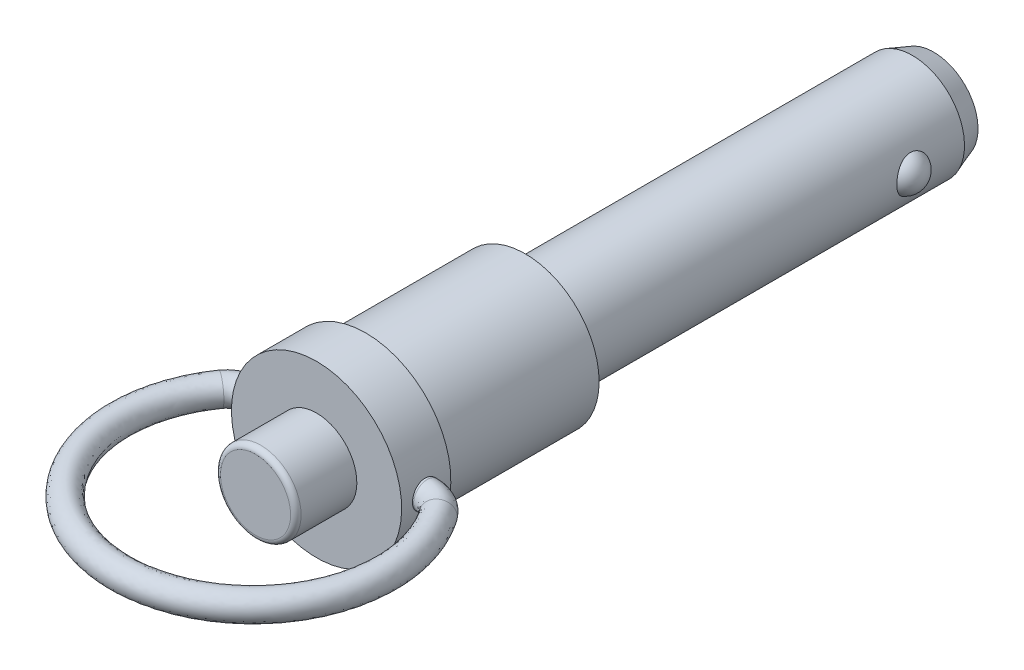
ISO-10303-21;
HEADER;
FILE_DESCRIPTION(('STEP AP214'),'2;1');
FILE_NAME('part.step','',(''),(''),'','','');
FILE_SCHEMA(('AUTOMOTIVE_DESIGN { 1 0 10303 214 1 1 1 1 }'));
ENDSEC;
DATA;
#1=APPLICATION_CONTEXT('core data for automotive mechanical design processes');
#2=APPLICATION_PROTOCOL_DEFINITION('international standard','automotive_design',2000,#1);
#3=PRODUCT_CONTEXT('',#1,'mechanical');
#4=PRODUCT('Part','Part','',(#3));
#5=PRODUCT_RELATED_PRODUCT_CATEGORY('part','',(#4));
#6=PRODUCT_DEFINITION_FORMATION('','',#4);
#7=PRODUCT_DEFINITION_CONTEXT('part definition',#1,'design');
#8=PRODUCT_DEFINITION('design','',#6,#7);
#9=PRODUCT_DEFINITION_SHAPE('','',#8);
#10=(LENGTH_UNIT() NAMED_UNIT(*) SI_UNIT(.MILLI.,.METRE.));
#11=(NAMED_UNIT(*) PLANE_ANGLE_UNIT() SI_UNIT($,.RADIAN.));
#12=(NAMED_UNIT(*) SI_UNIT($,.STERADIAN.) SOLID_ANGLE_UNIT());
#13=UNCERTAINTY_MEASURE_WITH_UNIT(LENGTH_MEASURE(1.E-05),#10,'distance_accuracy_value','');
#14=(GEOMETRIC_REPRESENTATION_CONTEXT(3) GLOBAL_UNCERTAINTY_ASSIGNED_CONTEXT((#13)) GLOBAL_UNIT_ASSIGNED_CONTEXT((#10,
#11,#12)) REPRESENTATION_CONTEXT('',''));
#15=CARTESIAN_POINT('',(0.,0.,0.));
#16=DIRECTION('',(0.,0.,1.));
#17=DIRECTION('',(1.,0.,0.));
#18=AXIS2_PLACEMENT_3D('',#15,#16,#17);
#19=CARTESIAN_POINT('',(0.,0.,25.765));
#20=DIRECTION('',(0.,0.,1.));
#21=DIRECTION('',(1.,0.,0.));
#22=AXIS2_PLACEMENT_3D('',#19,#20,#21);
#23=PLANE('',#22);
#24=CARTESIAN_POINT('',(0.,0.,25.765));
#25=DIRECTION('',(0.,0.,1.));
#26=DIRECTION('',(1.,0.,0.));
#27=AXIS2_PLACEMENT_3D('',#24,#25,#26);
#28=CIRCLE('',#27,3.3481);
#29=CARTESIAN_POINT('',(3.3481,0.,25.765));
#30=VERTEX_POINT('',#29);
#31=EDGE_CURVE('E140',#30,#30,#28,.T.);
#32=ORIENTED_EDGE('',*,*,#31,.T.);
#33=EDGE_LOOP('',(#32));
#34=FACE_BOUND('',#33,.T.);
#35=ADVANCED_FACE('F12',(#34),#23,.T.);
#36=CARTESIAN_POINT('',(0.,0.,25.265));
#37=DIRECTION('',(0.,0.,1.));
#38=DIRECTION('',(1.,0.,0.));
#39=AXIS2_PLACEMENT_3D('',#36,#37,#38);
#40=TOROIDAL_SURFACE('',#39,3.3481,0.5);
#41=CARTESIAN_POINT('',(0.,0.,25.265));
#42=DIRECTION('',(0.,0.,1.));
#43=DIRECTION('',(1.,0.,0.));
#44=AXIS2_PLACEMENT_3D('',#41,#42,#43);
#45=CIRCLE('',#44,3.8481);
#46=CARTESIAN_POINT('',(3.8481,0.,25.265));
#47=VERTEX_POINT('',#46);
#48=EDGE_CURVE('E137',#47,#47,#45,.T.);
#49=ORIENTED_EDGE('',*,*,#48,.T.);
#50=EDGE_LOOP('',(#49));
#51=FACE_BOUND('',#50,.T.);
#52=ORIENTED_EDGE('',*,*,#31,.F.);
#53=EDGE_LOOP('',(#52));
#54=FACE_BOUND('',#53,.T.);
#55=ADVANCED_FACE('F75',(#51,#54),#40,.T.);
#56=CARTESIAN_POINT('',(11.4497733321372,0.,17.9437724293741));
#57=CARTESIAN_POINT('',(11.8265676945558,0.,18.4801460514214));
#58=CARTESIAN_POINT('',(12.6551080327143,0.,19.8662433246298));
#59=CARTESIAN_POINT('',(13.4882796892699,0.,22.0133244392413));
#60=CARTESIAN_POINT('',(14.0014195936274,0.,24.4938075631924));
#61=CARTESIAN_POINT('',(14.0399868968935,0.,27.1482100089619));
#62=CARTESIAN_POINT('',(13.5501253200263,0.,29.8733661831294));
#63=CARTESIAN_POINT('',(12.5103672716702,0.,32.4943169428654));
#64=CARTESIAN_POINT('',(10.9649059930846,0.,34.8529407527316));
#65=CARTESIAN_POINT('',(9.01915526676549,0.,36.8217510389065));
#66=CARTESIAN_POINT('',(6.82219687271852,0.,38.3176313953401));
#67=CARTESIAN_POINT('',(4.51156788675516,0.,39.3254677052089));
#68=CARTESIAN_POINT('',(2.23137128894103,0.,39.879227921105));
#69=CARTESIAN_POINT('',(7.28333001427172E-13,0.,40.0580345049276));
#70=CARTESIAN_POINT('',(-2.23137128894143,0.,39.879227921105));
#71=CARTESIAN_POINT('',(-4.51156788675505,0.,39.3254677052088));
#72=CARTESIAN_POINT('',(-6.82219687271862,0.,38.31763139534));
#73=CARTESIAN_POINT('',(-9.01915526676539,0.,36.8217510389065));
#74=CARTESIAN_POINT('',(-10.9649059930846,0.,34.8529407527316));
#75=CARTESIAN_POINT('',(-12.5103672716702,0.,32.4943169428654));
#76=CARTESIAN_POINT('',(-13.5501253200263,0.,29.8733661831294));
#77=CARTESIAN_POINT('',(-14.0399868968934,0.,27.148210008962));
#78=CARTESIAN_POINT('',(-14.0014195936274,0.,24.4938075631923));
#79=CARTESIAN_POINT('',(-13.4882796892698,0.,22.0133244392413));
#80=CARTESIAN_POINT('',(-12.6551080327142,0.,19.8662433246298));
#81=CARTESIAN_POINT('',(-11.8265676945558,0.,18.4801460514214));
#82=CARTESIAN_POINT('',(-11.4497733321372,0.,17.9437724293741));
#83=CARTESIAN_POINT('',(11.4497733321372,-2.59999999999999,17.9437724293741));
#84=CARTESIAN_POINT('',(11.7096770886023,-2.59999999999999,18.3137501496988));
#85=CARTESIAN_POINT('',(12.7137877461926,-2.59999999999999,19.9497749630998));
#86=CARTESIAN_POINT('',(13.4708176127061,-2.59999999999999,21.9884668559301));
#87=CARTESIAN_POINT('',(14.0065482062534,-2.6,24.5011082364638));
#88=CARTESIAN_POINT('',(14.0385176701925,-2.59999999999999,27.1461185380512));
#89=CARTESIAN_POINT('',(13.5505344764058,-2.59999999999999,29.8739486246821));
#90=CARTESIAN_POINT('',(12.5102566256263,-2.59999999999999,32.4941594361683));
#91=CARTESIAN_POINT('',(10.9649350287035,-2.59999999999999,34.8529820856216));
#92=CARTESIAN_POINT('',(9.01914786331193,-2.6,36.8217404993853));
#93=CARTESIAN_POINT('',(6.82219870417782,-2.59999999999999,38.3176340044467));
#94=CARTESIAN_POINT('',(4.51156744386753,-2.59999999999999,39.3254670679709));
#95=CARTESIAN_POINT('',(2.23137138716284,-2.59999999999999,39.879228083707));
#96=CARTESIAN_POINT('',(7.28268272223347E-13,-2.59999999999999,40.0580344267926));
#97=CARTESIAN_POINT('',(-2.23137138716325,-2.6,39.879228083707));
#98=CARTESIAN_POINT('',(-4.51156744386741,-2.59999999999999,39.3254670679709));
#99=CARTESIAN_POINT('',(-6.82219870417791,-2.6,38.3176340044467));
#100=CARTESIAN_POINT('',(-9.01914786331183,-2.59999999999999,36.8217404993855));
#101=CARTESIAN_POINT('',(-10.9649350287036,-2.59999999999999,34.8529820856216));
#102=CARTESIAN_POINT('',(-12.5102566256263,-2.59999999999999,32.4941594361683));
#103=CARTESIAN_POINT('',(-13.5505344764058,-2.59999999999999,29.8739486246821));
#104=CARTESIAN_POINT('',(-14.0385176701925,-2.6,27.1461185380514));
#105=CARTESIAN_POINT('',(-14.0065482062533,-2.59999999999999,24.5011082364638));
#106=CARTESIAN_POINT('',(-13.4708176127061,-2.59999999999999,21.9884668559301));
#107=CARTESIAN_POINT('',(-12.7137877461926,-2.59999999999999,19.9497749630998));
#108=CARTESIAN_POINT('',(-11.7096770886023,-2.59999999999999,18.3137501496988));
#109=CARTESIAN_POINT('',(-11.4497733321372,-2.59999999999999,17.9437724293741));
#110=CARTESIAN_POINT('',(9.33442519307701,-2.59999999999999,19.4556422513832));
#111=CARTESIAN_POINT('',(9.59432894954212,-2.59999999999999,19.8256199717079));
#112=CARTESIAN_POINT('',(10.3328710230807,-2.59999999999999,21.0505437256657));
#113=CARTESIAN_POINT('',(10.9823054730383,-2.59999999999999,22.7644201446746));
#114=CARTESIAN_POINT('',(11.4042672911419,-2.6,24.7888114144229));
#115=CARTESIAN_POINT('',(11.4306312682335,-2.59999999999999,26.9493701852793));
#116=CARTESIAN_POINT('',(11.0308912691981,-2.59999999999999,29.1626260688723));
#117=CARTESIAN_POINT('',(10.1828123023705,-2.59999999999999,31.2968985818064));
#118=CARTESIAN_POINT('',(8.92160036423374,-2.59999999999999,33.2166725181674));
#119=CARTESIAN_POINT('',(7.34098330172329,-2.6,34.8144779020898));
#120=CARTESIAN_POINT('',(5.5491258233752,-2.59999999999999,36.0332448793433));
#121=CARTESIAN_POINT('',(3.67550207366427,-2.59999999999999,36.8497543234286));
#122=CARTESIAN_POINT('',(1.8109997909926,-2.59999999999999,37.3021941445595));
#123=CARTESIAN_POINT('',(-9.61358135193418E-13,-2.59999999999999,37.4469985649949));
#124=CARTESIAN_POINT('',(-1.81099979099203,-2.6,37.3021941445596));
#125=CARTESIAN_POINT('',(-3.6755020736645,-2.59999999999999,36.8497543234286));
#126=CARTESIAN_POINT('',(-5.54912582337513,-2.6,36.0332448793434));
#127=CARTESIAN_POINT('',(-7.34098330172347,-2.59999999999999,34.8144779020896));
#128=CARTESIAN_POINT('',(-8.92160036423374,-2.59999999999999,33.2166725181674));
#129=CARTESIAN_POINT('',(-10.1828123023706,-2.59999999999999,31.2968985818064));
#130=CARTESIAN_POINT('',(-11.0308912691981,-2.59999999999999,29.1626260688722));
#131=CARTESIAN_POINT('',(-11.4306312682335,-2.6,26.9493701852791));
#132=CARTESIAN_POINT('',(-11.4042672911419,-2.59999999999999,24.7888114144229));
#133=CARTESIAN_POINT('',(-10.9823054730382,-2.59999999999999,22.7644201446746));
#134=CARTESIAN_POINT('',(-10.3328710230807,-2.59999999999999,21.0505437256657));
#135=CARTESIAN_POINT('',(-9.59432894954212,-2.59999999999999,19.8256199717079));
#136=CARTESIAN_POINT('',(-9.33442519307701,-2.59999999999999,19.4556422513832));
#137=CARTESIAN_POINT('',(9.33442519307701,0.,19.4556422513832));
#138=CARTESIAN_POINT('',(9.65277425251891,0.,19.9088179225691));
#139=CARTESIAN_POINT('',(10.3035311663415,0.,21.0087779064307));
#140=CARTESIAN_POINT('',(10.9910365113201,0.,22.7768489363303));
#141=CARTESIAN_POINT('',(11.4017029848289,0.,24.7851610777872));
#142=CARTESIAN_POINT('',(11.431365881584,0.,26.9504159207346));
#143=CARTESIAN_POINT('',(11.0306866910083,0.,29.1623348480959));
#144=CARTESIAN_POINT('',(10.1828676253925,0.,31.2969773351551));
#145=CARTESIAN_POINT('',(8.92158584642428,0.,33.2166518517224));
#146=CARTESIAN_POINT('',(7.34098700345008,0.,34.8144831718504));
#147=CARTESIAN_POINT('',(5.54912490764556,0.,36.03324357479));
#148=CARTESIAN_POINT('',(3.67550229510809,0.,36.8497546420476));
#149=CARTESIAN_POINT('',(1.8109997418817,0.,37.3021940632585));
#150=CARTESIAN_POINT('',(-9.6127182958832E-13,0.,37.4469986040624));
#151=CARTESIAN_POINT('',(-1.81099974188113,0.,37.3021940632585));
#152=CARTESIAN_POINT('',(-3.67550229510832,0.,36.8497546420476));
#153=CARTESIAN_POINT('',(-5.54912490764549,0.,36.03324357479));
#154=CARTESIAN_POINT('',(-7.34098700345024,0.,34.8144831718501));
#155=CARTESIAN_POINT('',(-8.92158584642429,0.,33.2166518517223));
#156=CARTESIAN_POINT('',(-10.1828676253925,0.,31.296977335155));
#157=CARTESIAN_POINT('',(-11.0306866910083,0.,29.1623348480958));
#158=CARTESIAN_POINT('',(-11.431365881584,0.,26.9504159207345));
#159=CARTESIAN_POINT('',(-11.4017029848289,0.,24.7851610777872));
#160=CARTESIAN_POINT('',(-10.9910365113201,0.,22.7768489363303));
#161=CARTESIAN_POINT('',(-10.3035311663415,0.,21.0087779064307));
#162=CARTESIAN_POINT('',(-9.6527742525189,0.,19.9088179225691));
#163=CARTESIAN_POINT('',(-9.33442519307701,0.,19.4556422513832));
#164=CARTESIAN_POINT('',(9.33442519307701,2.59999999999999,19.4556422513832));
#165=CARTESIAN_POINT('',(9.7112195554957,2.59999999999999,19.9920158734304));
#166=CARTESIAN_POINT('',(10.2741913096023,2.59999999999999,20.9670120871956));
#167=CARTESIAN_POINT('',(10.999767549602,2.59999999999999,22.7892777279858));
#168=CARTESIAN_POINT('',(11.3991386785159,2.6,24.7815107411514));
#169=CARTESIAN_POINT('',(11.4321004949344,2.59999999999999,26.9514616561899));
#170=CARTESIAN_POINT('',(11.0304821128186,2.59999999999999,29.1620436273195));
#171=CARTESIAN_POINT('',(10.1829229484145,2.59999999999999,31.2970560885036));
#172=CARTESIAN_POINT('',(8.92157132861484,2.59999999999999,33.2166311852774));
#173=CARTESIAN_POINT('',(7.34099070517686,2.6,34.8144884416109));
#174=CARTESIAN_POINT('',(5.54912399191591,2.59999999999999,36.0332422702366));
#175=CARTESIAN_POINT('',(3.67550251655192,2.59999999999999,36.8497549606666));
#176=CARTESIAN_POINT('',(1.81099969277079,2.59999999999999,37.3021939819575));
#177=CARTESIAN_POINT('',(-9.61422864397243E-13,2.59999999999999,37.4469986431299));
#178=CARTESIAN_POINT('',(-1.81099969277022,2.6,37.3021939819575));
#179=CARTESIAN_POINT('',(-3.67550251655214,2.59999999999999,36.8497549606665));
#180=CARTESIAN_POINT('',(-5.54912399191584,2.6,36.0332422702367));
#181=CARTESIAN_POINT('',(-7.34099070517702,2.59999999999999,34.8144884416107));
#182=CARTESIAN_POINT('',(-8.92157132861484,2.59999999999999,33.2166311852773));
#183=CARTESIAN_POINT('',(-10.1829229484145,2.59999999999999,31.2970560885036));
#184=CARTESIAN_POINT('',(-11.0304821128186,2.59999999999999,29.1620436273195));
#185=CARTESIAN_POINT('',(-11.4321004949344,2.6,26.9514616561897));
#186=CARTESIAN_POINT('',(-11.3991386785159,2.59999999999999,24.7815107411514));
#187=CARTESIAN_POINT('',(-10.999767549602,2.59999999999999,22.7892777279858));
#188=CARTESIAN_POINT('',(-10.2741913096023,2.59999999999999,20.9670120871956));
#189=CARTESIAN_POINT('',(-9.71121955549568,2.59999999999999,19.9920158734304));
#190=CARTESIAN_POINT('',(-9.33442519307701,2.59999999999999,19.4556422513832));
#191=CARTESIAN_POINT('',(11.4497733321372,2.59999999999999,17.9437724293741));
#192=CARTESIAN_POINT('',(11.9434583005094,2.59999999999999,18.6465419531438));
#193=CARTESIAN_POINT('',(12.5964283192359,2.59999999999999,19.7827116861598));
#194=CARTESIAN_POINT('',(13.5057417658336,2.59999999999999,22.0381820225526));
#195=CARTESIAN_POINT('',(13.9962909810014,2.6,24.4865068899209));
#196=CARTESIAN_POINT('',(14.0414561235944,2.59999999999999,27.1503014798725));
#197=CARTESIAN_POINT('',(13.5497161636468,2.59999999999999,29.8727837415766));
#198=CARTESIAN_POINT('',(12.5104779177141,2.59999999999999,32.4944744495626));
#199=CARTESIAN_POINT('',(10.9648769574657,2.59999999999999,34.8528994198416));
#200=CARTESIAN_POINT('',(9.01916267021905,2.6,36.8217615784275));
#201=CARTESIAN_POINT('',(6.82219504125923,2.59999999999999,38.3176287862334));
#202=CARTESIAN_POINT('',(4.5115683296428,2.59999999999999,39.3254683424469));
#203=CARTESIAN_POINT('',(2.23137119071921,2.59999999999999,39.8792277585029));
#204=CARTESIAN_POINT('',(7.28203543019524E-13,2.59999999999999,40.0580345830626));
#205=CARTESIAN_POINT('',(-2.23137119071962,2.6,39.879227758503));
#206=CARTESIAN_POINT('',(-4.51156832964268,2.59999999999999,39.3254683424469));
#207=CARTESIAN_POINT('',(-6.82219504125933,2.6,38.3176287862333));
#208=CARTESIAN_POINT('',(-9.01916267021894,2.59999999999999,36.8217615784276));
#209=CARTESIAN_POINT('',(-10.9648769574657,2.59999999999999,34.8528994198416));
#210=CARTESIAN_POINT('',(-12.5104779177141,2.59999999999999,32.4944744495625));
#211=CARTESIAN_POINT('',(-13.5497161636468,2.59999999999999,29.8727837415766));
#212=CARTESIAN_POINT('',(-14.0414561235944,2.6,27.1503014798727));
#213=CARTESIAN_POINT('',(-13.9962909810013,2.59999999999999,24.4865068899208));
#214=CARTESIAN_POINT('',(-13.5057417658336,2.59999999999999,22.0381820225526));
#215=CARTESIAN_POINT('',(-12.5964283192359,2.59999999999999,19.7827116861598));
#216=CARTESIAN_POINT('',(-11.9434583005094,2.59999999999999,18.6465419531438));
#217=CARTESIAN_POINT('',(-11.4497733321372,2.59999999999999,17.9437724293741));
#218=CARTESIAN_POINT('',(11.4497733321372,0.,17.9437724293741));
#219=CARTESIAN_POINT('',(11.8265676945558,0.,18.4801460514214));
#220=CARTESIAN_POINT('',(12.6551080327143,0.,19.8662433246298));
#221=CARTESIAN_POINT('',(13.4882796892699,0.,22.0133244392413));
#222=CARTESIAN_POINT('',(14.0014195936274,0.,24.4938075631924));
#223=CARTESIAN_POINT('',(14.0399868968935,0.,27.1482100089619));
#224=CARTESIAN_POINT('',(13.5501253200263,0.,29.8733661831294));
#225=CARTESIAN_POINT('',(12.5103672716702,0.,32.4943169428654));
#226=CARTESIAN_POINT('',(10.9649059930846,0.,34.8529407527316));
#227=CARTESIAN_POINT('',(9.01915526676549,0.,36.8217510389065));
#228=CARTESIAN_POINT('',(6.82219687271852,0.,38.3176313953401));
#229=CARTESIAN_POINT('',(4.51156788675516,0.,39.3254677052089));
#230=CARTESIAN_POINT('',(2.23137128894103,0.,39.879227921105));
#231=CARTESIAN_POINT('',(7.28333001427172E-13,0.,40.0580345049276));
#232=CARTESIAN_POINT('',(-2.23137128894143,0.,39.879227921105));
#233=CARTESIAN_POINT('',(-4.51156788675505,0.,39.3254677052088));
#234=CARTESIAN_POINT('',(-6.82219687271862,0.,38.31763139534));
#235=CARTESIAN_POINT('',(-9.01915526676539,0.,36.8217510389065));
#236=CARTESIAN_POINT('',(-10.9649059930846,0.,34.8529407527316));
#237=CARTESIAN_POINT('',(-12.5103672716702,0.,32.4943169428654));
#238=CARTESIAN_POINT('',(-13.5501253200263,0.,29.8733661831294));
#239=CARTESIAN_POINT('',(-14.0399868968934,0.,27.148210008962));
#240=CARTESIAN_POINT('',(-14.0014195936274,0.,24.4938075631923));
#241=CARTESIAN_POINT('',(-13.4882796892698,0.,22.0133244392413));
#242=CARTESIAN_POINT('',(-12.6551080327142,0.,19.8662433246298));
#243=CARTESIAN_POINT('',(-11.8265676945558,0.,18.4801460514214));
#244=CARTESIAN_POINT('',(-11.4497733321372,0.,17.9437724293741));
#245=(BOUNDED_SURFACE() B_SPLINE_SURFACE(3,3,((#56,#57,#58,#59,#60,#61,#62,#63,#64,#65,#66,#67,
#68,#69,#70,#71,#72,#73,#74,#75,#76,#77,#78,#79,#80,#81,#82),(#83,#84,#85,#86,#87,#88,#89,#90,
#91,#92,#93,#94,#95,#96,#97,#98,#99,#100,#101,#102,#103,#104,#105,#106,#107,#108,#109),(#110,
#111,#112,#113,#114,#115,#116,#117,#118,#119,#120,#121,#122,#123,#124,#125,#126,#127,#128,#129,
#130,#131,#132,#133,#134,#135,#136),(#137,#138,#139,#140,#141,#142,#143,#144,#145,#146,#147,
#148,#149,#150,#151,#152,#153,#154,#155,#156,#157,#158,#159,#160,#161,#162,#163),(#164,#165,
#166,#167,#168,#169,#170,#171,#172,#173,#174,#175,#176,#177,#178,#179,#180,#181,#182,#183,#184,
#185,#186,#187,#188,#189,#190),(#191,#192,#193,#194,#195,#196,#197,#198,#199,#200,#201,#202,
#203,#204,#205,#206,#207,#208,#209,#210,#211,#212,#213,#214,#215,#216,#217),(#218,#219,#220,
#221,#222,#223,#224,#225,#226,#227,#228,#229,#230,#231,#232,#233,#234,#235,#236,#237,#238,#239,
#240,#241,#242,#243,#244)),.UNSPECIFIED.,.T.,.F.,.F.) B_SPLINE_SURFACE_WITH_KNOTS((4,3,4),(4,1,
1,1,1,1,1,1,1,1,1,1,1,1,1,1,1,1,1,1,1,1,1,1,4),(0.,0.5,1.),(0.,0.0355177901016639,
0.0739139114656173,0.114982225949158,0.158533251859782,0.203808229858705,0.250000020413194,
0.296191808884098,0.34146678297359,0.385017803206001,0.426086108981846,0.464482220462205,0.5,
0.535517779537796,0.573913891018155,0.614982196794,0.658533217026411,0.703808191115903,
0.749999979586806,0.796191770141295,0.841466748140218,0.885017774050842,0.926086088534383,
0.964482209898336,1.),
.UNSPECIFIED.) GEOMETRIC_REPRESENTATION_ITEM() RATIONAL_B_SPLINE_SURFACE(((1.,1.,1.,1.,1.,1.,1.,
1.,1.,1.,1.,1.,1.,1.,1.,1.,1.,1.,1.,1.,1.,1.,1.,1.,1.,1.,1.),(0.333333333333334,
0.333333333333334,0.333333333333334,0.333333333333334,0.333333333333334,0.333333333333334,
0.333333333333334,0.333333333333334,0.333333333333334,0.333333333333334,0.333333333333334,
0.333333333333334,0.333333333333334,0.333333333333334,0.333333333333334,0.333333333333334,
0.333333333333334,0.333333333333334,0.333333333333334,0.333333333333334,0.333333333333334,
0.333333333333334,0.333333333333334,0.333333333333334,0.333333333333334,0.333333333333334,
0.333333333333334),(0.333333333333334,0.333333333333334,0.333333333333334,0.333333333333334,
0.333333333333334,0.333333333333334,0.333333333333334,0.333333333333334,0.333333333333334,
0.333333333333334,0.333333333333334,0.333333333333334,0.333333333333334,0.333333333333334,
0.333333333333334,0.333333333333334,0.333333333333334,0.333333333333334,0.333333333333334,
0.333333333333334,0.333333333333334,0.333333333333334,0.333333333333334,0.333333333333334,
0.333333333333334,0.333333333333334,0.333333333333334),(1.,1.,1.,1.,1.,1.,1.,1.,1.,1.,1.,1.,1.,
1.,1.,1.,1.,1.,1.,1.,1.,1.,1.,1.,1.,1.,1.),(0.333333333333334,0.333333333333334,
0.333333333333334,0.333333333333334,0.333333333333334,0.333333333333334,0.333333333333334,
0.333333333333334,0.333333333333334,0.333333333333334,0.333333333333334,0.333333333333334,
0.333333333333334,0.333333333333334,0.333333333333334,0.333333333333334,0.333333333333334,
0.333333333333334,0.333333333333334,0.333333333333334,0.333333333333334,0.333333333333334,
0.333333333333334,0.333333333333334,0.333333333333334,0.333333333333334,0.333333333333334),
(0.333333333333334,0.333333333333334,0.333333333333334,0.333333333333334,0.333333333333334,
0.333333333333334,0.333333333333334,0.333333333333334,0.333333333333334,0.333333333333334,
0.333333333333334,0.333333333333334,0.333333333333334,0.333333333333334,0.333333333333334,
0.333333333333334,0.333333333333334,0.333333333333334,0.333333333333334,0.333333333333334,
0.333333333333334,0.333333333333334,0.333333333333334,0.333333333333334,0.333333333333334,
0.333333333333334,0.333333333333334),(1.,1.,1.,1.,1.,1.,1.,1.,1.,1.,1.,1.,1.,1.,1.,1.,1.,1.,1.,
1.,1.,1.,1.,1.,1.,1.,1.))) REPRESENTATION_ITEM('') SURFACE());
#246=CARTESIAN_POINT('',(11.4497733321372,0.,17.9437724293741));
#247=CARTESIAN_POINT('',(11.4497733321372,-2.59999999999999,17.9437724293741));
#248=CARTESIAN_POINT('',(9.33442519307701,-2.59999999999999,19.4556422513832));
#249=CARTESIAN_POINT('',(9.33442519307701,0.,19.4556422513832));
#250=CARTESIAN_POINT('',(9.33442519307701,2.59999999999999,19.4556422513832));
#251=CARTESIAN_POINT('',(11.4497733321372,2.59999999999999,17.9437724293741));
#252=CARTESIAN_POINT('',(11.4497733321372,0.,17.9437724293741));
#253=(BOUNDED_CURVE() B_SPLINE_CURVE(3,(#246,#247,#248,#249,#250,#251,#252),.UNSPECIFIED.,.T.,
.F.) B_SPLINE_CURVE_WITH_KNOTS((4,3,4),(0.,0.5,1.),
.UNSPECIFIED.) CURVE() GEOMETRIC_REPRESENTATION_ITEM() RATIONAL_B_SPLINE_CURVE((1.,
0.333333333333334,0.333333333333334,1.,0.333333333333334,0.333333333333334,1.)) REPRESENTATION_ITEM(''));
#254=CARTESIAN_POINT('',(11.4497733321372,0.,17.9437724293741));
#255=VERTEX_POINT('',#254);
#256=EDGE_CURVE('E175',#255,#255,#253,.T.);
#257=CARTESIAN_POINT('',(-11.4497733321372,0.,17.9437724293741));
#258=CARTESIAN_POINT('',(-11.4497733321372,-2.59999999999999,17.9437724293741));
#259=CARTESIAN_POINT('',(-9.33442519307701,-2.59999999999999,19.4556422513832));
#260=CARTESIAN_POINT('',(-9.33442519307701,0.,19.4556422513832));
#261=CARTESIAN_POINT('',(-9.33442519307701,2.59999999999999,19.4556422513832));
#262=CARTESIAN_POINT('',(-11.4497733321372,2.59999999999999,17.9437724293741));
#263=CARTESIAN_POINT('',(-11.4497733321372,0.,17.9437724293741));
#264=(BOUNDED_CURVE() B_SPLINE_CURVE(3,(#257,#258,#259,#260,#261,#262,#263),.UNSPECIFIED.,.T.,
.F.) B_SPLINE_CURVE_WITH_KNOTS((4,3,4),(0.,0.5,1.),
.UNSPECIFIED.) CURVE() GEOMETRIC_REPRESENTATION_ITEM() RATIONAL_B_SPLINE_CURVE((1.,
0.333333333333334,0.333333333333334,1.,0.333333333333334,0.333333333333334,1.)) REPRESENTATION_ITEM(''));
#265=CARTESIAN_POINT('',(-11.4497733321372,0.,17.9437724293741));
#266=VERTEX_POINT('',#265);
#267=EDGE_CURVE('E173',#266,#266,#264,.F.);
#268=ORIENTED_EDGE('',*,*,#256,.F.);
#269=EDGE_LOOP('',(#268));
#270=FACE_BOUND('',#269,.T.);
#271=ORIENTED_EDGE('',*,*,#267,.F.);
#272=EDGE_LOOP('',(#271));
#273=FACE_BOUND('',#272,.T.);
#274=ADVANCED_FACE('F81',(#270,#273),#245,.F.);
#275=CARTESIAN_POINT('',(8.23717073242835,0.,16.3022));
#276=CARTESIAN_POINT('',(8.39026579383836,0.,16.3022));
#277=CARTESIAN_POINT('',(8.96971374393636,0.,16.3453113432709));
#278=CARTESIAN_POINT('',(9.59211406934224,0.,16.5211040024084));
#279=CARTESIAN_POINT('',(10.3031381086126,0.,16.8555507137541));
#280=CARTESIAN_POINT('',(10.8955792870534,0.,17.2786190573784));
#281=CARTESIAN_POINT('',(11.3434296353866,0.,17.7975125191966));
#282=CARTESIAN_POINT('',(11.4497733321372,0.,17.9437724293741));
#283=CARTESIAN_POINT('',(8.23717073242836,2.59999999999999,16.3022));
#284=CARTESIAN_POINT('',(8.16213736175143,2.59999999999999,16.3022));
#285=CARTESIAN_POINT('',(9.0792865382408,2.59999999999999,16.3469383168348));
#286=CARTESIAN_POINT('',(9.55822083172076,2.6,16.5152316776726));
#287=CARTESIAN_POINT('',(10.3298909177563,2.59999999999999,16.879237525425));
#288=CARTESIAN_POINT('',(10.8172738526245,2.59999999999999,17.1748054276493));
#289=CARTESIAN_POINT('',(11.5008843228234,2.59999999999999,18.0140679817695));
#290=CARTESIAN_POINT('',(11.4497733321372,2.59999999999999,17.9437724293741));
#291=CARTESIAN_POINT('',(8.23717073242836,2.59999999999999,18.9022));
#292=CARTESIAN_POINT('',(8.16213736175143,2.59999999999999,18.9022));
#293=CARTESIAN_POINT('',(8.54034086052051,2.59999999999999,18.9167455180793));
#294=CARTESIAN_POINT('',(8.68812752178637,2.6,18.9762506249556));
#295=CARTESIAN_POINT('',(8.94759350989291,2.59999999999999,19.0969960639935));
#296=CARTESIAN_POINT('',(9.10292826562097,2.59999999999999,19.1770581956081));
#297=CARTESIAN_POINT('',(9.38553618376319,2.59999999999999,19.5259378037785));
#298=CARTESIAN_POINT('',(9.33442519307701,2.59999999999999,19.4556422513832));
#299=CARTESIAN_POINT('',(8.23717073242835,0.,18.9022));
#300=CARTESIAN_POINT('',(8.2762015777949,0.,18.9022));
#301=CARTESIAN_POINT('',(8.48555446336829,0.,18.9159320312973));
#302=CARTESIAN_POINT('',(8.70507414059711,0.,18.9791867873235));
#303=CARTESIAN_POINT('',(8.93421710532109,0.,19.0851526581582));
#304=CARTESIAN_POINT('',(9.14208098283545,0.,19.2289650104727));
#305=CARTESIAN_POINT('',(9.30680884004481,0.,19.4176600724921));
#306=CARTESIAN_POINT('',(9.33442519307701,0.,19.4556422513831));
#307=CARTESIAN_POINT('',(8.23717073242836,-2.59999999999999,18.9022));
#308=CARTESIAN_POINT('',(8.39026579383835,-2.59999999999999,18.9022));
#309=CARTESIAN_POINT('',(8.43076806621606,-2.59999999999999,18.9151185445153));
#310=CARTESIAN_POINT('',(8.72202075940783,-2.6,18.9821229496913));
#311=CARTESIAN_POINT('',(8.92084070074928,-2.59999999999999,19.0733092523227));
#312=CARTESIAN_POINT('',(9.1812337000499,-2.59999999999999,19.2808718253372));
#313=CARTESIAN_POINT('',(9.22808149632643,-2.59999999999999,19.3093823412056));
#314=CARTESIAN_POINT('',(9.33442519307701,-2.59999999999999,19.4556422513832));
#315=CARTESIAN_POINT('',(8.23717073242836,-2.59999999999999,16.3022));
#316=CARTESIAN_POINT('',(8.61839422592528,-2.59999999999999,16.3022));
#317=CARTESIAN_POINT('',(8.8601409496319,-2.59999999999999,16.3436843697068));
#318=CARTESIAN_POINT('',(9.6260073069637,-2.6,16.5269763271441));
#319=CARTESIAN_POINT('',(10.276385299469,-2.59999999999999,16.8318639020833));
#320=CARTESIAN_POINT('',(10.9738847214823,-2.59999999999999,17.3824326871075));
#321=CARTESIAN_POINT('',(11.1859749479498,-2.59999999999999,17.5809570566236));
#322=CARTESIAN_POINT('',(11.4497733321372,-2.59999999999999,17.9437724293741));
#323=CARTESIAN_POINT('',(8.23717073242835,0.,16.3022));
#324=CARTESIAN_POINT('',(8.39026579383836,0.,16.3022));
#325=CARTESIAN_POINT('',(8.96971374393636,0.,16.3453113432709));
#326=CARTESIAN_POINT('',(9.59211406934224,0.,16.5211040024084));
#327=CARTESIAN_POINT('',(10.3031381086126,0.,16.8555507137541));
#328=CARTESIAN_POINT('',(10.8955792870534,0.,17.2786190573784));
#329=CARTESIAN_POINT('',(11.3434296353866,0.,17.7975125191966));
#330=CARTESIAN_POINT('',(11.4497733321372,0.,17.9437724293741));
#331=(BOUNDED_SURFACE() B_SPLINE_SURFACE(3,3,((#275,#276,#277,#278,#279,#280,#281,#282),(#283,
#284,#285,#286,#287,#288,#289,#290),(#291,#292,#293,#294,#295,#296,#297,#298),(#299,#300,#301,
#302,#303,#304,#305,#306),(#307,#308,#309,#310,#311,#312,#313,#314),(#315,#316,#317,#318,#319,
#320,#321,#322),(#323,#324,#325,#326,#327,#328,#329,#330)),.UNSPECIFIED.,.T.,.F.,
.F.) B_SPLINE_SURFACE_WITH_KNOTS((4,3,4),(4,1,1,1,1,4),(0.,0.5,1.),(0.,0.183393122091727,
0.371127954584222,0.561360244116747,0.78346967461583,1.),
.UNSPECIFIED.) GEOMETRIC_REPRESENTATION_ITEM() RATIONAL_B_SPLINE_SURFACE(((1.,1.,1.,1.,1.,1.,1.,
1.),(0.333333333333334,0.333333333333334,0.333333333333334,0.333333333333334,0.333333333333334,
0.333333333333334,0.333333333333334,0.333333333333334),(0.333333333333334,0.333333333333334,
0.333333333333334,0.333333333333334,0.333333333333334,0.333333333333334,0.333333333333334,
0.333333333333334),(1.,1.,1.,1.,1.,1.,1.,1.),(0.333333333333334,0.333333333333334,
0.333333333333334,0.333333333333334,0.333333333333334,0.333333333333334,0.333333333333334,
0.333333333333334),(0.333333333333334,0.333333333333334,0.333333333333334,0.333333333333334,
0.333333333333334,0.333333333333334,0.333333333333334,0.333333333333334),(1.,1.,1.,1.,1.,1.,1.,1.))) REPRESENTATION_ITEM('') SURFACE());
#332=CARTESIAN_POINT('',(8.23717073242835,0.,17.6022));
#333=DIRECTION('',(1.,0.,0.));
#334=DIRECTION('',(0.,0.,-1.));
#335=AXIS2_PLACEMENT_3D('',#332,#333,#334);
#336=CIRCLE('',#335,1.3);
#337=CARTESIAN_POINT('',(8.23717073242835,0.,16.3022));
#338=VERTEX_POINT('',#337);
#339=EDGE_CURVE('E111',#338,#338,#336,.T.);
#340=ORIENTED_EDGE('',*,*,#339,.T.);
#341=EDGE_LOOP('',(#340));
#342=FACE_BOUND('',#341,.T.);
#343=ORIENTED_EDGE('',*,*,#256,.T.);
#344=EDGE_LOOP('',(#343));
#345=FACE_BOUND('',#344,.T.);
#346=ADVANCED_FACE('F91',(#342,#345),#331,.T.);
#347=CARTESIAN_POINT('',(0.,0.,24.765));
#348=DIRECTION('',(0.,0.,-1.));
#349=DIRECTION('',(0.,1.,0.));
#350=AXIS2_PLACEMENT_3D('',#347,#348,#349);
#351=CYLINDRICAL_SURFACE('',#350,3.8481);
#352=CARTESIAN_POINT('',(0.,0.,19.939));
#353=DIRECTION('',(0.,0.,-1.));
#354=DIRECTION('',(0.,1.,0.));
#355=AXIS2_PLACEMENT_3D('',#352,#353,#354);
#356=CIRCLE('',#355,3.8481);
#357=CARTESIAN_POINT('',(0.,3.8481,19.939));
#358=VERTEX_POINT('',#357);
#359=EDGE_CURVE('E147',#358,#358,#356,.T.);
#360=ORIENTED_EDGE('',*,*,#359,.F.);
#361=EDGE_LOOP('',(#360));
#362=FACE_BOUND('',#361,.T.);
#363=ORIENTED_EDGE('',*,*,#48,.F.);
#364=EDGE_LOOP('',(#363));
#365=FACE_BOUND('',#364,.T.);
#366=ADVANCED_FACE('F87',(#362,#365),#351,.T.);
#367=CARTESIAN_POINT('',(-11.4497733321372,0.,17.9437724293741));
#368=CARTESIAN_POINT('',(-11.3597411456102,0.,17.8199465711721));
#369=CARTESIAN_POINT('',(-10.985804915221,0.,17.3752654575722));
#370=CARTESIAN_POINT('',(-10.4784291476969,0.,16.9741029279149));
#371=CARTESIAN_POINT('',(-9.7908926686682,0.,16.5936956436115));
#372=CARTESIAN_POINT('',(-9.10089921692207,0.,16.3618307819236));
#373=CARTESIAN_POINT('',(-8.41800257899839,0.,16.3022));
#374=CARTESIAN_POINT('',(-8.23717073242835,0.,16.3022));
#375=CARTESIAN_POINT('',(-11.4497733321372,2.59999999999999,17.9437724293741));
#376=CARTESIAN_POINT('',(-11.4938947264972,2.59999999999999,18.0044548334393));
#377=CARTESIAN_POINT('',(-10.9200537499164,2.59999999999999,17.2876012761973));
#378=CARTESIAN_POINT('',(-10.503110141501,2.6,16.9980618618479));
#379=CARTESIAN_POINT('',(-9.75600116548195,2.59999999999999,16.585987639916));
#380=CARTESIAN_POINT('',(-9.23091765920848,2.59999999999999,16.3641146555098));
#381=CARTESIAN_POINT('',(-8.15024985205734,2.59999999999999,16.3022));
#382=CARTESIAN_POINT('',(-8.23717073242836,2.59999999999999,16.3022));
#383=CARTESIAN_POINT('',(-9.33442519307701,2.59999999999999,19.4556422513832));
#384=CARTESIAN_POINT('',(-9.37854658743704,2.59999999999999,19.5163246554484));
#385=CARTESIAN_POINT('',(-9.14268985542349,2.59999999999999,19.2203693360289));
#386=CARTESIAN_POINT('',(-9.00682479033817,2.6,19.1369648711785));
#387=CARTESIAN_POINT('',(-8.7554763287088,2.59999999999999,19.0001197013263));
#388=CARTESIAN_POINT('',(-8.59879927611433,2.59999999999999,18.9230559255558));
#389=CARTESIAN_POINT('',(-8.15024985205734,2.59999999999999,18.9022));
#390=CARTESIAN_POINT('',(-8.23717073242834,2.59999999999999,18.9022));
#391=CARTESIAN_POINT('',(-9.334425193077,0.,19.4556422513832));
#392=CARTESIAN_POINT('',(-9.31146979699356,0.,19.4240705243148));
#393=CARTESIAN_POINT('',(-9.17556543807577,0.,19.2642014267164));
#394=CARTESIAN_POINT('',(-8.99448429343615,0.,19.124985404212));
#395=CARTESIAN_POINT('',(-8.77292208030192,0.,19.0039737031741));
#396=CARTESIAN_POINT('',(-8.53379005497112,0.,18.9219139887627));
#397=CARTESIAN_POINT('',(-8.28412621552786,0.,18.9022));
#398=CARTESIAN_POINT('',(-8.23717073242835,0.,18.9022));
#399=CARTESIAN_POINT('',(-9.33442519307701,-2.59999999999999,19.4556422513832));
#400=CARTESIAN_POINT('',(-9.24439300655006,-2.59999999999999,19.3318163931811));
#401=CARTESIAN_POINT('',(-9.20844102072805,-2.59999999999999,19.3080335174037));
#402=CARTESIAN_POINT('',(-8.98214379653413,-2.6,19.1130059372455));
#403=CARTESIAN_POINT('',(-8.79036783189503,-2.59999999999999,19.0078277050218));
#404=CARTESIAN_POINT('',(-8.46878083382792,-2.59999999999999,18.9207720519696));
#405=CARTESIAN_POINT('',(-8.41800257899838,-2.59999999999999,18.9022));
#406=CARTESIAN_POINT('',(-8.23717073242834,-2.59999999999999,18.9022));
#407=CARTESIAN_POINT('',(-11.4497733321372,-2.59999999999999,17.9437724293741));
#408=CARTESIAN_POINT('',(-11.2255875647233,-2.59999999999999,17.6354383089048));
#409=CARTESIAN_POINT('',(-11.0515560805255,-2.59999999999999,17.4629296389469));
#410=CARTESIAN_POINT('',(-10.4537481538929,-2.6,16.9501439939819));
#411=CARTESIAN_POINT('',(-9.82578417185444,-2.59999999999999,16.6014036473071));
#412=CARTESIAN_POINT('',(-8.97088077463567,-2.59999999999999,16.3595469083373));
#413=CARTESIAN_POINT('',(-8.68575530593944,-2.59999999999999,16.3022));
#414=CARTESIAN_POINT('',(-8.23717073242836,-2.59999999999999,16.3022));
#415=CARTESIAN_POINT('',(-11.4497733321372,0.,17.9437724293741));
#416=CARTESIAN_POINT('',(-11.3597411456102,0.,17.8199465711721));
#417=CARTESIAN_POINT('',(-10.985804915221,0.,17.3752654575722));
#418=CARTESIAN_POINT('',(-10.4784291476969,0.,16.9741029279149));
#419=CARTESIAN_POINT('',(-9.7908926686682,0.,16.5936956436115));
#420=CARTESIAN_POINT('',(-9.10089921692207,0.,16.3618307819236));
#421=CARTESIAN_POINT('',(-8.41800257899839,0.,16.3022));
#422=CARTESIAN_POINT('',(-8.23717073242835,0.,16.3022));
#423=(BOUNDED_SURFACE() B_SPLINE_SURFACE(3,3,((#367,#368,#369,#370,#371,#372,#373,#374),(#375,
#376,#377,#378,#379,#380,#381,#382),(#383,#384,#385,#386,#387,#388,#389,#390),(#391,#392,#393,
#394,#395,#396,#397,#398),(#399,#400,#401,#402,#403,#404,#405,#406),(#407,#408,#409,#410,#411,
#412,#413,#414),(#415,#416,#417,#418,#419,#420,#421,#422)),.UNSPECIFIED.,.T.,.F.,
.F.) B_SPLINE_SURFACE_WITH_KNOTS((4,3,4),(4,1,1,1,1,4),(0.,0.5,1.),(0.,0.183394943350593,
0.371130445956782,0.561362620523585,0.783471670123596,1.),
.UNSPECIFIED.) GEOMETRIC_REPRESENTATION_ITEM() RATIONAL_B_SPLINE_SURFACE(((1.,1.,1.,1.,1.,1.,1.,
1.),(0.333333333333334,0.333333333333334,0.333333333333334,0.333333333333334,0.333333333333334,
0.333333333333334,0.333333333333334,0.333333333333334),(0.333333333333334,0.333333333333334,
0.333333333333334,0.333333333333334,0.333333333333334,0.333333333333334,0.333333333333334,
0.333333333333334),(1.,1.,1.,1.,1.,1.,1.,1.),(0.333333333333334,0.333333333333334,
0.333333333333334,0.333333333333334,0.333333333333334,0.333333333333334,0.333333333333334,
0.333333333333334),(0.333333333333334,0.333333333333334,0.333333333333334,0.333333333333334,
0.333333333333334,0.333333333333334,0.333333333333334,0.333333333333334),(1.,1.,1.,1.,1.,1.,1.,1.))) REPRESENTATION_ITEM('') SURFACE());
#424=CARTESIAN_POINT('',(-8.23717073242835,0.,17.6022));
#425=DIRECTION('',(-1.,0.,0.));
#426=DIRECTION('',(0.,0.,1.));
#427=AXIS2_PLACEMENT_3D('',#424,#425,#426);
#428=CIRCLE('',#427,1.3);
#429=CARTESIAN_POINT('',(-8.23717073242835,0.,18.9022));
#430=VERTEX_POINT('',#429);
#431=EDGE_CURVE('E179',#430,#430,#428,.T.);
#432=ORIENTED_EDGE('',*,*,#267,.T.);
#433=EDGE_LOOP('',(#432));
#434=FACE_BOUND('',#433,.T.);
#435=ORIENTED_EDGE('',*,*,#431,.T.);
#436=EDGE_LOOP('',(#435));
#437=FACE_BOUND('',#436,.T.);
#438=ADVANCED_FACE('F90',(#434,#437),#423,.T.);
#439=CARTESIAN_POINT('',(8.23717073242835,0.,17.6022));
#440=DIRECTION('',(-1.,0.,0.));
#441=DIRECTION('',(0.,0.,1.));
#442=AXIS2_PLACEMENT_3D('',#439,#440,#441);
#443=CYLINDRICAL_SURFACE('',#442,1.3);
#444=CARTESIAN_POINT('',(8.128,0.,18.9022));
#445=CARTESIAN_POINT('',(8.12799878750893,0.072525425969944,18.9021970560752));
#446=CARTESIAN_POINT('',(8.12701915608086,0.145091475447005,18.8961103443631));
#447=CARTESIAN_POINT('',(8.12320552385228,0.288191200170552,18.8719327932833));
#448=CARTESIAN_POINT('',(8.1203697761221,0.358722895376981,18.8538306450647));
#449=CARTESIAN_POINT('',(8.11316223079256,0.495662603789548,18.8061803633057));
#450=CARTESIAN_POINT('',(8.1087916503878,0.562073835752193,18.7766412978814));
#451=CARTESIAN_POINT('',(8.09899598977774,0.688988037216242,18.706978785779));
#452=CARTESIAN_POINT('',(8.09357104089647,0.749491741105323,18.6668566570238));
#453=CARTESIAN_POINT('',(8.08221522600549,0.863417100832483,18.5767896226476));
#454=CARTESIAN_POINT('',(8.07628069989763,0.916778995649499,18.5267695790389));
#455=CARTESIAN_POINT('',(8.06460286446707,1.01439001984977,18.4184883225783));
#456=CARTESIAN_POINT('',(8.05885956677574,1.05863859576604,18.3602266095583));
#457=CARTESIAN_POINT('',(8.04817900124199,1.1370036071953,18.2367090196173));
#458=CARTESIAN_POINT('',(8.04324646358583,1.17106147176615,18.1714155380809));
#459=CARTESIAN_POINT('',(8.03479635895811,1.22770383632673,18.0359425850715));
#460=CARTESIAN_POINT('',(8.03127870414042,1.25028904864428,17.9657634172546));
#461=CARTESIAN_POINT('',(8.02609290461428,1.28315781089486,17.8231426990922));
#462=CARTESIAN_POINT('',(8.02440930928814,1.29354418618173,17.7507254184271));
#463=CARTESIAN_POINT('',(8.02303544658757,1.30203914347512,17.6051578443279));
#464=CARTESIAN_POINT('',(8.02334504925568,1.30014852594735,17.532007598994));
#465=CARTESIAN_POINT('',(8.02590848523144,1.28422703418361,17.3877813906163));
#466=CARTESIAN_POINT('',(8.02814388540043,1.27031125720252,17.3166923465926));
#467=CARTESIAN_POINT('',(8.03427821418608,1.23091490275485,17.1778712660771));
#468=CARTESIAN_POINT('',(8.03817719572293,1.20543395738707,17.110139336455));
#469=CARTESIAN_POINT('',(8.04721946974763,1.14351263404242,16.9796082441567));
#470=CARTESIAN_POINT('',(8.0523682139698,1.10702406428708,16.9168323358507));
#471=CARTESIAN_POINT('',(8.06332603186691,1.02415752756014,16.7982506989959));
#472=CARTESIAN_POINT('',(8.06913515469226,0.977778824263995,16.7424454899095));
#473=CARTESIAN_POINT('',(8.08084037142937,0.875819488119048,16.6387227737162));
#474=CARTESIAN_POINT('',(8.08673670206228,0.820140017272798,16.5909023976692));
#475=CARTESIAN_POINT('',(8.09789065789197,0.701495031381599,16.5052692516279));
#476=CARTESIAN_POINT('',(8.10314827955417,0.638529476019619,16.467456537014));
#477=CARTESIAN_POINT('',(8.11243904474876,0.507011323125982,16.402904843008));
#478=CARTESIAN_POINT('',(8.11647128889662,0.438454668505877,16.3761739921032));
#479=CARTESIAN_POINT('',(8.1228496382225,0.297746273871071,16.3346325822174));
#480=CARTESIAN_POINT('',(8.12519587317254,0.225594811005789,16.3198211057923));
#481=CARTESIAN_POINT('',(8.12792050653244,0.0805825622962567,16.3026695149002));
#482=CARTESIAN_POINT('',(8.12831995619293,0.00773793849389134,16.3001959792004));
#483=CARTESIAN_POINT('',(8.12716352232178,-0.137325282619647,16.3074354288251));
#484=CARTESIAN_POINT('',(8.12560770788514,-0.209543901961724,16.3171479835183));
#485=CARTESIAN_POINT('',(8.12072858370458,-0.350896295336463,16.3483729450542));
#486=CARTESIAN_POINT('',(8.11741510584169,-0.420044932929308,16.3698197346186));
#487=CARTESIAN_POINT('',(8.10939080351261,-0.553765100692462,16.4238347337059));
#488=CARTESIAN_POINT('',(8.10467990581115,-0.61833639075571,16.4564035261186));
#489=CARTESIAN_POINT('',(8.09433146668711,-0.741651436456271,16.5320466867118));
#490=CARTESIAN_POINT('',(8.08868664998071,-0.800343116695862,16.5752049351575));
#491=CARTESIAN_POINT('',(8.07711967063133,-0.909698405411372,16.67068593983));
#492=CARTESIAN_POINT('',(8.0711974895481,-0.960361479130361,16.7230093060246));
#493=CARTESIAN_POINT('',(8.05967572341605,-1.05271221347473,16.8359318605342));
#494=CARTESIAN_POINT('',(8.05407973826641,-1.09431001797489,16.896604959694));
#495=CARTESIAN_POINT('',(8.04390974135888,-1.16672309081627,17.024155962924));
#496=CARTESIAN_POINT('',(8.03933569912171,-1.19753868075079,17.0910336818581));
#497=CARTESIAN_POINT('',(8.03175410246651,-1.24737615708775,17.2288373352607));
#498=CARTESIAN_POINT('',(8.02874047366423,-1.26644383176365,17.2997463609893));
#499=CARTESIAN_POINT('',(8.02460529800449,-1.29238901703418,17.4438126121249));
#500=CARTESIAN_POINT('',(8.02348360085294,-1.29926749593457,17.5169696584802));
#501=CARTESIAN_POINT('',(8.02326541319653,-1.30061367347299,17.6625587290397));
#502=CARTESIAN_POINT('',(8.0241458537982,-1.29522274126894,17.7349894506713));
#503=CARTESIAN_POINT('',(8.02778235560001,-1.27248767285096,17.8778995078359));
#504=CARTESIAN_POINT('',(8.03053841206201,-1.25514356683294,17.9483788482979));
#505=CARTESIAN_POINT('',(8.03760713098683,-1.20904693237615,18.0853372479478));
#506=CARTESIAN_POINT('',(8.04191826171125,-1.18030562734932,18.1518201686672));
#507=CARTESIAN_POINT('',(8.0516130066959,-1.11224476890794,18.2790433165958));
#508=CARTESIAN_POINT('',(8.05699666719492,-1.07292475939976,18.3397832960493));
#509=CARTESIAN_POINT('',(8.06830344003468,-0.984314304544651,18.4545123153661));
#510=CARTESIAN_POINT('',(8.07423180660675,-0.934919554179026,18.508420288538));
#511=CARTESIAN_POINT('',(8.08591729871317,-0.827782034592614,18.6072314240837));
#512=CARTESIAN_POINT('',(8.09167438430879,-0.770037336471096,18.6521325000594));
#513=CARTESIAN_POINT('',(8.10241053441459,-0.647407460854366,18.7319120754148));
#514=CARTESIAN_POINT('',(8.10738445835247,-0.582479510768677,18.7667255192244));
#515=CARTESIAN_POINT('',(8.11594372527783,-0.447646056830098,18.8248990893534));
#516=CARTESIAN_POINT('',(8.11953047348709,-0.377745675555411,18.8482708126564));
#517=CARTESIAN_POINT('',(8.12411350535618,-0.25629650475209,18.8777288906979));
#518=CARTESIAN_POINT('',(8.12556327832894,-0.205488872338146,18.8868911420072));
#519=CARTESIAN_POINT('',(8.12750694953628,-0.103127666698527,18.8991276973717));
#520=CARTESIAN_POINT('',(8.1280008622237,-0.0515741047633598,18.9022020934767));
#521=CARTESIAN_POINT('',(8.128,0.,18.9022));
#522=B_SPLINE_CURVE_WITH_KNOTS('',3,(#444,#445,#446,#447,#448,#449,#450,#451,#452,#453,#454,
#455,#456,#457,#458,#459,#460,#461,#462,#463,#464,#465,#466,#467,#468,#469,#470,#471,#472,#473,
#474,#475,#476,#477,#478,#479,#480,#481,#482,#483,#484,#485,#486,#487,#488,#489,#490,#491,#492,
#493,#494,#495,#496,#497,#498,#499,#500,#501,#502,#503,#504,#505,#506,#507,#508,#509,#510,#511,
#512,#513,#514,#515,#516,#517,#518,#519,#520,#521),.UNSPECIFIED.,.T.,.F.,(4,2,2,2,2,2,2,2,2,2,2,
2,2,2,2,2,2,2,2,2,2,2,2,2,2,2,2,2,2,2,2,2,2,2,2,2,2,2,4),(0.,0.217387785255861,0.43498046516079,
0.652400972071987,0.869794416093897,1.08890626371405,1.30803141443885,1.52839280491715,
1.74874051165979,1.96721724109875,2.18567972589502,2.40207409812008,2.6184753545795,
2.83583812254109,3.05321707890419,3.27307317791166,3.49293049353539,3.71294878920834,
3.93295014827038,4.15056719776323,4.36817655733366,4.58458131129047,4.80099740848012,
5.01918647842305,5.23739007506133,5.45766698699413,5.67793732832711,5.89734362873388,
6.11673249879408,6.33360636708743,6.5504796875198,6.76713996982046,6.98380959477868,
7.2028480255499,7.42193713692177,7.64240922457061,7.86265738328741,8.01724799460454,
8.17183626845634),.UNSPECIFIED.);
#523=CARTESIAN_POINT('',(8.128,0.,18.9022));
#524=VERTEX_POINT('',#523);
#525=EDGE_CURVE('E29',#524,#524,#522,.T.);
#526=ORIENTED_EDGE('',*,*,#525,.F.);
#527=EDGE_LOOP('',(#526));
#528=FACE_BOUND('',#527,.T.);
#529=ORIENTED_EDGE('',*,*,#339,.F.);
#530=EDGE_LOOP('',(#529));
#531=FACE_BOUND('',#530,.T.);
#532=ADVANCED_FACE('F96',(#528,#531),#443,.T.);
#533=CARTESIAN_POINT('',(8.128,0.,19.939));
#534=DIRECTION('',(0.,0.,1.));
#535=DIRECTION('',(0.,-1.,0.));
#536=AXIS2_PLACEMENT_3D('',#533,#534,#535);
#537=PLANE('',#536);
#538=ORIENTED_EDGE('',*,*,#359,.T.);
#539=EDGE_LOOP('',(#538));
#540=FACE_BOUND('',#539,.T.);
#541=CARTESIAN_POINT('',(0.,0.,19.939));
#542=DIRECTION('',(0.,0.,-1.));
#543=DIRECTION('',(0.,1.,0.));
#544=AXIS2_PLACEMENT_3D('',#541,#542,#543);
#545=CIRCLE('',#544,8.128);
#546=CARTESIAN_POINT('',(0.,8.128,19.939));
#547=VERTEX_POINT('',#546);
#548=EDGE_CURVE('E151',#547,#547,#545,.T.);
#549=ORIENTED_EDGE('',*,*,#548,.F.);
#550=EDGE_LOOP('',(#549));
#551=FACE_BOUND('',#550,.T.);
#552=ADVANCED_FACE('F93',(#540,#551),#537,.T.);
#553=CARTESIAN_POINT('',(-8.128,0.,18.9022));
#554=CARTESIAN_POINT('',(-8.12799878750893,-0.072525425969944,18.9021970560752));
#555=CARTESIAN_POINT('',(-8.12701915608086,-0.145091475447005,18.8961103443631));
#556=CARTESIAN_POINT('',(-8.12320552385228,-0.288191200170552,18.8719327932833));
#557=CARTESIAN_POINT('',(-8.1203697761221,-0.358722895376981,18.8538306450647));
#558=CARTESIAN_POINT('',(-8.11316223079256,-0.495662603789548,18.8061803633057));
#559=CARTESIAN_POINT('',(-8.1087916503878,-0.562073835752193,18.7766412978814));
#560=CARTESIAN_POINT('',(-8.09899598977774,-0.688988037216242,18.706978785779));
#561=CARTESIAN_POINT('',(-8.09357104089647,-0.749491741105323,18.6668566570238));
#562=CARTESIAN_POINT('',(-8.08221522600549,-0.863417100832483,18.5767896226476));
#563=CARTESIAN_POINT('',(-8.07628069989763,-0.916778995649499,18.5267695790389));
#564=CARTESIAN_POINT('',(-8.06460286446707,-1.01439001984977,18.4184883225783));
#565=CARTESIAN_POINT('',(-8.05885956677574,-1.05863859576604,18.3602266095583));
#566=CARTESIAN_POINT('',(-8.04817900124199,-1.1370036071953,18.2367090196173));
#567=CARTESIAN_POINT('',(-8.04324646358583,-1.17106147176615,18.1714155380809));
#568=CARTESIAN_POINT('',(-8.03479635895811,-1.22770383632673,18.0359425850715));
#569=CARTESIAN_POINT('',(-8.03127870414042,-1.25028904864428,17.9657634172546));
#570=CARTESIAN_POINT('',(-8.02609290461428,-1.28315781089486,17.8231426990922));
#571=CARTESIAN_POINT('',(-8.02440930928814,-1.29354418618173,17.7507254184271));
#572=CARTESIAN_POINT('',(-8.02303544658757,-1.30203914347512,17.6051578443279));
#573=CARTESIAN_POINT('',(-8.02334504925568,-1.30014852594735,17.532007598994));
#574=CARTESIAN_POINT('',(-8.02590848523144,-1.28422703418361,17.3877813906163));
#575=CARTESIAN_POINT('',(-8.02814388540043,-1.27031125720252,17.3166923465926));
#576=CARTESIAN_POINT('',(-8.03427821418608,-1.23091490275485,17.1778712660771));
#577=CARTESIAN_POINT('',(-8.03817719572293,-1.20543395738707,17.110139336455));
#578=CARTESIAN_POINT('',(-8.04721946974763,-1.14351263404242,16.9796082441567));
#579=CARTESIAN_POINT('',(-8.0523682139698,-1.10702406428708,16.9168323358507));
#580=CARTESIAN_POINT('',(-8.06332603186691,-1.02415752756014,16.7982506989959));
#581=CARTESIAN_POINT('',(-8.06913515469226,-0.977778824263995,16.7424454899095));
#582=CARTESIAN_POINT('',(-8.08084037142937,-0.875819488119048,16.6387227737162));
#583=CARTESIAN_POINT('',(-8.08673670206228,-0.820140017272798,16.5909023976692));
#584=CARTESIAN_POINT('',(-8.09789065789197,-0.701495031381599,16.5052692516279));
#585=CARTESIAN_POINT('',(-8.10314827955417,-0.638529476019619,16.467456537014));
#586=CARTESIAN_POINT('',(-8.11243904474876,-0.507011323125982,16.402904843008));
#587=CARTESIAN_POINT('',(-8.11647128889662,-0.438454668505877,16.3761739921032));
#588=CARTESIAN_POINT('',(-8.1228496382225,-0.297746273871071,16.3346325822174));
#589=CARTESIAN_POINT('',(-8.12519587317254,-0.225594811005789,16.3198211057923));
#590=CARTESIAN_POINT('',(-8.12792050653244,-0.0805825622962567,16.3026695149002));
#591=CARTESIAN_POINT('',(-8.12831995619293,-0.00773793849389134,16.3001959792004));
#592=CARTESIAN_POINT('',(-8.12716352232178,0.137325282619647,16.3074354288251));
#593=CARTESIAN_POINT('',(-8.12560770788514,0.209543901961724,16.3171479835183));
#594=CARTESIAN_POINT('',(-8.12072858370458,0.350896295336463,16.3483729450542));
#595=CARTESIAN_POINT('',(-8.11741510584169,0.420044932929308,16.3698197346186));
#596=CARTESIAN_POINT('',(-8.10939080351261,0.553765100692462,16.4238347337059));
#597=CARTESIAN_POINT('',(-8.10467990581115,0.61833639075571,16.4564035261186));
#598=CARTESIAN_POINT('',(-8.09433146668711,0.741651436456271,16.5320466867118));
#599=CARTESIAN_POINT('',(-8.08868664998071,0.800343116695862,16.5752049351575));
#600=CARTESIAN_POINT('',(-8.07711967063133,0.909698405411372,16.67068593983));
#601=CARTESIAN_POINT('',(-8.0711974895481,0.960361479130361,16.7230093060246));
#602=CARTESIAN_POINT('',(-8.05967572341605,1.05271221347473,16.8359318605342));
#603=CARTESIAN_POINT('',(-8.05407973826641,1.09431001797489,16.896604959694));
#604=CARTESIAN_POINT('',(-8.04390974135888,1.16672309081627,17.024155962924));
#605=CARTESIAN_POINT('',(-8.03933569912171,1.19753868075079,17.0910336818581));
#606=CARTESIAN_POINT('',(-8.03175410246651,1.24737615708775,17.2288373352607));
#607=CARTESIAN_POINT('',(-8.02874047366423,1.26644383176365,17.2997463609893));
#608=CARTESIAN_POINT('',(-8.02460529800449,1.29238901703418,17.4438126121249));
#609=CARTESIAN_POINT('',(-8.02348360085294,1.29926749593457,17.5169696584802));
#610=CARTESIAN_POINT('',(-8.02326541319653,1.30061367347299,17.6625587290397));
#611=CARTESIAN_POINT('',(-8.0241458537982,1.29522274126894,17.7349894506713));
#612=CARTESIAN_POINT('',(-8.02778235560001,1.27248767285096,17.8778995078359));
#613=CARTESIAN_POINT('',(-8.03053841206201,1.25514356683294,17.9483788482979));
#614=CARTESIAN_POINT('',(-8.03760713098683,1.20904693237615,18.0853372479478));
#615=CARTESIAN_POINT('',(-8.04191826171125,1.18030562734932,18.1518201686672));
#616=CARTESIAN_POINT('',(-8.0516130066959,1.11224476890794,18.2790433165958));
#617=CARTESIAN_POINT('',(-8.05699666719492,1.07292475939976,18.3397832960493));
#618=CARTESIAN_POINT('',(-8.06830344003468,0.984314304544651,18.4545123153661));
#619=CARTESIAN_POINT('',(-8.07423180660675,0.934919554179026,18.508420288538));
#620=CARTESIAN_POINT('',(-8.08591729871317,0.827782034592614,18.6072314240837));
#621=CARTESIAN_POINT('',(-8.09167438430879,0.770037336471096,18.6521325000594));
#622=CARTESIAN_POINT('',(-8.10241053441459,0.647407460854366,18.7319120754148));
#623=CARTESIAN_POINT('',(-8.10738445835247,0.582479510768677,18.7667255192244));
#624=CARTESIAN_POINT('',(-8.11594372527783,0.447646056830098,18.8248990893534));
#625=CARTESIAN_POINT('',(-8.11953047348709,0.377745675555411,18.8482708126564));
#626=CARTESIAN_POINT('',(-8.12411350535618,0.25629650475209,18.8777288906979));
#627=CARTESIAN_POINT('',(-8.12556327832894,0.205488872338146,18.8868911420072));
#628=CARTESIAN_POINT('',(-8.12750694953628,0.103127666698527,18.8991276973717));
#629=CARTESIAN_POINT('',(-8.1280008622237,0.0515741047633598,18.9022020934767));
#630=CARTESIAN_POINT('',(-8.128,0.,18.9022));
#631=B_SPLINE_CURVE_WITH_KNOTS('',3,(#553,#554,#555,#556,#557,#558,#559,#560,#561,#562,#563,
#564,#565,#566,#567,#568,#569,#570,#571,#572,#573,#574,#575,#576,#577,#578,#579,#580,#581,#582,
#583,#584,#585,#586,#587,#588,#589,#590,#591,#592,#593,#594,#595,#596,#597,#598,#599,#600,#601,
#602,#603,#604,#605,#606,#607,#608,#609,#610,#611,#612,#613,#614,#615,#616,#617,#618,#619,#620,
#621,#622,#623,#624,#625,#626,#627,#628,#629,#630),.UNSPECIFIED.,.T.,.F.,(4,2,2,2,2,2,2,2,2,2,2,
2,2,2,2,2,2,2,2,2,2,2,2,2,2,2,2,2,2,2,2,2,2,2,2,2,2,2,4),(0.,0.217387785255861,0.43498046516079,
0.652400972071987,0.869794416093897,1.08890626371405,1.30803141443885,1.52839280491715,
1.74874051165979,1.96721724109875,2.18567972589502,2.40207409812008,2.6184753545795,
2.83583812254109,3.05321707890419,3.27307317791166,3.49293049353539,3.71294878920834,
3.93295014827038,4.15056719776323,4.36817655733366,4.58458131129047,4.80099740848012,
5.01918647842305,5.23739007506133,5.45766698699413,5.67793732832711,5.89734362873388,
6.11673249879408,6.33360636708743,6.5504796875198,6.76713996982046,6.98380959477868,
7.2028480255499,7.42193713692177,7.64240922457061,7.86265738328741,8.01724799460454,
8.17183626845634),.UNSPECIFIED.);
#632=CARTESIAN_POINT('',(-8.128,0.,18.9022));
#633=VERTEX_POINT('',#632);
#634=EDGE_CURVE('E106',#633,#633,#631,.T.);
#635=ORIENTED_EDGE('',*,*,#634,.F.);
#636=EDGE_LOOP('',(#635));
#637=FACE_BOUND('',#636,.T.);
#638=ORIENTED_EDGE('',*,*,#431,.F.);
#639=EDGE_LOOP('',(#638));
#640=FACE_BOUND('',#639,.T.);
#641=ADVANCED_FACE('F95',(#637,#640),#443,.T.);
#642=CARTESIAN_POINT('',(0.,0.,0.));
#643=DIRECTION('',(0.,0.,-1.));
#644=DIRECTION('',(0.,1.,0.));
#645=AXIS2_PLACEMENT_3D('',#642,#643,#644);
#646=CYLINDRICAL_SURFACE('',#645,8.128);
#647=ORIENTED_EDGE('',*,*,#634,.T.);
#648=EDGE_LOOP('',(#647));
#649=FACE_BOUND('',#648,.T.);
#650=CARTESIAN_POINT('',(0.,0.,15.24));
#651=DIRECTION('',(0.,0.,-1.));
#652=DIRECTION('',(0.,1.,0.));
#653=AXIS2_PLACEMENT_3D('',#650,#651,#652);
#654=CIRCLE('',#653,8.128);
#655=CARTESIAN_POINT('',(0.,8.128,15.24));
#656=VERTEX_POINT('',#655);
#657=EDGE_CURVE('E148',#656,#656,#654,.T.);
#658=ORIENTED_EDGE('',*,*,#657,.F.);
#659=EDGE_LOOP('',(#658));
#660=FACE_BOUND('',#659,.T.);
#661=ORIENTED_EDGE('',*,*,#548,.T.);
#662=EDGE_LOOP('',(#661));
#663=FACE_BOUND('',#662,.T.);
#664=ORIENTED_EDGE('',*,*,#525,.T.);
#665=EDGE_LOOP('',(#664));
#666=FACE_BOUND('',#665,.T.);
#667=ADVANCED_FACE('F98',(#649,#660,#663,#666),#646,.T.);
#668=CARTESIAN_POINT('',(7.493,0.,15.24));
#669=DIRECTION('',(0.,0.,-1.));
#670=DIRECTION('',(0.,1.,0.));
#671=AXIS2_PLACEMENT_3D('',#668,#669,#670);
#672=PLANE('',#671);
#673=CARTESIAN_POINT('',(0.,0.,15.24));
#674=DIRECTION('',(0.,0.,-1.));
#675=DIRECTION('',(0.,1.,0.));
#676=AXIS2_PLACEMENT_3D('',#673,#674,#675);
#677=CIRCLE('',#676,7.45);
#678=CARTESIAN_POINT('',(0.,7.45,15.24));
#679=VERTEX_POINT('',#678);
#680=EDGE_CURVE('E25',#679,#679,#677,.F.);
#681=ORIENTED_EDGE('',*,*,#680,.T.);
#682=EDGE_LOOP('',(#681));
#683=FACE_BOUND('',#682,.T.);
#684=ORIENTED_EDGE('',*,*,#657,.T.);
#685=EDGE_LOOP('',(#684));
#686=FACE_BOUND('',#685,.T.);
#687=ADVANCED_FACE('F102',(#683,#686),#672,.T.);
#688=CARTESIAN_POINT('',(0.,0.,14.84));
#689=DIRECTION('',(0.,0.,-1.));
#690=DIRECTION('',(0.,1.,0.));
#691=AXIS2_PLACEMENT_3D('',#688,#689,#690);
#692=TOROIDAL_SURFACE('',#691,7.45,0.4);
#693=CARTESIAN_POINT('',(0.,0.,14.84));
#694=DIRECTION('',(0.,0.,-1.));
#695=DIRECTION('',(0.,1.,0.));
#696=AXIS2_PLACEMENT_3D('',#693,#694,#695);
#697=CIRCLE('',#696,7.05);
#698=CARTESIAN_POINT('',(0.,7.05,14.84));
#699=VERTEX_POINT('',#698);
#700=EDGE_CURVE('E20',#699,#699,#697,.T.);
#701=ORIENTED_EDGE('',*,*,#700,.F.);
#702=EDGE_LOOP('',(#701));
#703=FACE_BOUND('',#702,.T.);
#704=ORIENTED_EDGE('',*,*,#680,.F.);
#705=EDGE_LOOP('',(#704));
#706=FACE_BOUND('',#705,.T.);
#707=ADVANCED_FACE('F124',(#703,#706),#692,.F.);
#708=CARTESIAN_POINT('',(0.,0.,27.0467872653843));
#709=DIRECTION('',(0.,0.,1.));
#710=DIRECTION('',(1.,0.,0.));
#711=AXIS2_PLACEMENT_3D('',#708,#709,#710);
#712=CYLINDRICAL_SURFACE('',#711,7.05);
#713=ORIENTED_EDGE('',*,*,#700,.T.);
#714=EDGE_LOOP('',(#713));
#715=FACE_BOUND('',#714,.T.);
#716=CARTESIAN_POINT('',(0.,0.,0.));
#717=DIRECTION('',(0.,0.,1.));
#718=DIRECTION('',(1.,0.,0.));
#719=AXIS2_PLACEMENT_3D('',#716,#717,#718);
#720=CIRCLE('',#719,7.05);
#721=CARTESIAN_POINT('',(7.05,0.,0.));
#722=VERTEX_POINT('',#721);
#723=EDGE_CURVE('E136',#722,#722,#720,.T.);
#724=ORIENTED_EDGE('',*,*,#723,.T.);
#725=EDGE_LOOP('',(#724));
#726=FACE_BOUND('',#725,.T.);
#727=ADVANCED_FACE('F120',(#715,#726),#712,.T.);
#728=CARTESIAN_POINT('',(0.,0.,0.));
#729=DIRECTION('',(0.,0.,-1.));
#730=DIRECTION('',(0.,1.,0.));
#731=AXIS2_PLACEMENT_3D('',#728,#729,#730);
#732=PLANE('',#731);
#733=ORIENTED_EDGE('',*,*,#723,.F.);
#734=EDGE_LOOP('',(#733));
#735=FACE_BOUND('',#734,.T.);
#736=CARTESIAN_POINT('',(0.,0.,0.));
#737=DIRECTION('',(0.,0.,-1.));
#738=DIRECTION('',(0.,1.,0.));
#739=AXIS2_PLACEMENT_3D('',#736,#737,#738);
#740=CIRCLE('',#739,4.96951);
#741=CARTESIAN_POINT('',(0.,4.96950999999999,0.));
#742=VERTEX_POINT('',#741);
#743=EDGE_CURVE('E8',#742,#742,#740,.F.);
#744=ORIENTED_EDGE('',*,*,#743,.T.);
#745=EDGE_LOOP('',(#744));
#746=FACE_BOUND('',#745,.T.);
#747=ADVANCED_FACE('F123',(#735,#746),#732,.T.);
#748=CARTESIAN_POINT('',(4.22992248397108,0.,-39.0106));
#749=DIRECTION('',(0.,0.,1.));
#750=DIRECTION('',(0.,-1.,0.));
#751=AXIS2_PLACEMENT_3D('',#748,#749,#750);
#752=PLANE('',#751);
#753=CARTESIAN_POINT('',(0.,0.,-39.0105999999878));
#754=DIRECTION('',(0.,0.,1.));
#755=DIRECTION('',(0.,-1.,0.));
#756=AXIS2_PLACEMENT_3D('',#753,#754,#755);
#757=CIRCLE('',#756,4.22992248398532);
#758=CARTESIAN_POINT('',(0.,-4.22992248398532,-39.0105999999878));
#759=VERTEX_POINT('',#758);
#760=EDGE_CURVE('E16',#759,#759,#757,.T.);
#761=ORIENTED_EDGE('',*,*,#760,.F.);
#762=EDGE_LOOP('',(#761));
#763=FACE_BOUND('',#762,.T.);
#764=ADVANCED_FACE('F47',(#763),#752,.F.);
#765=CARTESIAN_POINT('',(4.14528,0.,-32.1018));
#766=DIRECTION('',(0.,0.,1.));
#767=DIRECTION('',(1.,0.,0.));
#768=AXIS2_PLACEMENT_3D('',#765,#766,#767);
#769=SPHERICAL_SURFACE('',#768,1.78562);
#770=CARTESIAN_POINT('',(4.96951,0.,-30.5177912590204));
#771=CARTESIAN_POINT('',(4.96950607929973,0.0989420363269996,-30.5177939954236));
#772=CARTESIAN_POINT('',(4.96652601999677,0.197972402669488,-30.5255413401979));
#773=CARTESIAN_POINT('',(4.9548871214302,0.393364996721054,-30.5564575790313));
#774=CARTESIAN_POINT('',(4.94621961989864,0.489722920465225,-30.5796499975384));
#775=CARTESIAN_POINT('',(4.92409154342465,0.67692874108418,-30.6411551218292));
#776=CARTESIAN_POINT('',(4.91063084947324,0.767776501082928,-30.6794682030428));
#777=CARTESIAN_POINT('',(4.88035492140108,0.94123379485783,-30.7706319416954));
#778=CARTESIAN_POINT('',(4.86354066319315,1.02384571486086,-30.8234783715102));
#779=CARTESIAN_POINT('',(4.82872838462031,1.17707237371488,-30.9418991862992));
#780=CARTESIAN_POINT('',(4.81075207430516,1.2478494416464,-31.0072693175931));
#781=CARTESIAN_POINT('',(4.77554803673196,1.376454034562,-31.1499084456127));
#782=CARTESIAN_POINT('',(4.75832009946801,1.43428521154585,-31.2271740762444));
#783=CARTESIAN_POINT('',(4.7278067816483,1.53177669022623,-31.3868084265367));
#784=CARTESIAN_POINT('',(4.71434983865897,1.57230137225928,-31.4686150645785));
#785=CARTESIAN_POINT('',(4.69186742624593,1.63818072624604,-31.6386872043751));
#786=CARTESIAN_POINT('',(4.68283895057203,1.66354569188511,-31.7269482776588));
#787=CARTESIAN_POINT('',(4.6709836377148,1.69653228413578,-31.8994503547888));
#788=CARTESIAN_POINT('',(4.66770209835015,1.70545809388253,-31.9834120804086));
#789=CARTESIAN_POINT('',(4.66631401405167,1.70925445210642,-32.1516845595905));
#790=CARTESIAN_POINT('',(4.6682059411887,1.70412915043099,-32.2359952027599));
#791=CARTESIAN_POINT('',(4.67672634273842,1.68059540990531,-32.3985435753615));
#792=CARTESIAN_POINT('',(4.68313557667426,1.66280143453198,-32.4768831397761));
#793=CARTESIAN_POINT('',(4.69974058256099,1.61527018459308,-32.6294056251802));
#794=CARTESIAN_POINT('',(4.70993669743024,1.58553182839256,-32.7035881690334));
#795=CARTESIAN_POINT('',(4.73339939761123,1.51406854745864,-32.8481011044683));
#796=CARTESIAN_POINT('',(4.74674458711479,1.4720287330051,-32.9182634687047));
#797=CARTESIAN_POINT('',(4.76791353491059,1.40129782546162,-33.0176828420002));
#798=CARTESIAN_POINT('',(4.77516406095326,1.37643370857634,-33.049860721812));
#799=CARTESIAN_POINT('',(4.78988709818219,1.32429117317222,-33.112185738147));
#800=CARTESIAN_POINT('',(4.79735977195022,1.29701095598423,-33.1423313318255));
#801=CARTESIAN_POINT('',(4.82096563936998,1.20759667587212,-33.2338189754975));
#802=CARTESIAN_POINT('',(4.83719300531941,1.14140257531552,-33.2912462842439));
#803=CARTESIAN_POINT('',(4.86827537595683,1.00055962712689,-33.3950513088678));
#804=CARTESIAN_POINT('',(4.88312976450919,0.92590701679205,-33.4414240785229));
#805=CARTESIAN_POINT('',(4.90385674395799,0.806241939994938,-33.5036735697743));
#806=CARTESIAN_POINT('',(4.91070233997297,0.763519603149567,-33.5237258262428));
#807=CARTESIAN_POINT('',(4.92344025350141,0.676535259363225,-33.5603862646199));
#808=CARTESIAN_POINT('',(4.92933338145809,0.632274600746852,-33.5769973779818));
#809=CARTESIAN_POINT('',(4.94535278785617,0.497629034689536,-33.6215733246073));
#810=CARTESIAN_POINT('',(4.95384366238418,0.405242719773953,-33.644351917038));
#811=CARTESIAN_POINT('',(4.96296311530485,0.260199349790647,-33.6686021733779));
#812=CARTESIAN_POINT('',(4.96541051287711,0.208410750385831,-33.6750499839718));
#813=CARTESIAN_POINT('',(4.96868499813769,0.104422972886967,-33.6836540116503));
#814=CARTESIAN_POINT('',(4.96951206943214,0.0522237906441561,-33.6858101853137));
#815=CARTESIAN_POINT('',(4.96950607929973,-0.0989420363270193,-33.6858060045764));
#816=CARTESIAN_POINT('',(4.96652601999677,-0.197972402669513,-33.6780586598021));
#817=CARTESIAN_POINT('',(4.9548871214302,-0.393364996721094,-33.6471424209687));
#818=CARTESIAN_POINT('',(4.94621961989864,-0.489722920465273,-33.6239500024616));
#819=CARTESIAN_POINT('',(4.92409154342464,-0.676928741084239,-33.5624448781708));
#820=CARTESIAN_POINT('',(4.91063084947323,-0.76777650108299,-33.5241317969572));
#821=CARTESIAN_POINT('',(4.88035492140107,-0.9412337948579,-33.4329680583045));
#822=CARTESIAN_POINT('',(4.86354066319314,-1.02384571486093,-33.3801216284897));
#823=CARTESIAN_POINT('',(4.8287283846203,-1.17707237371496,-33.2617008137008));
#824=CARTESIAN_POINT('',(4.81075207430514,-1.24784944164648,-33.1963306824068));
#825=CARTESIAN_POINT('',(4.77554803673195,-1.37645403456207,-33.0536915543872));
#826=CARTESIAN_POINT('',(4.758320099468,-1.43428521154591,-32.9764259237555));
#827=CARTESIAN_POINT('',(4.7278067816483,-1.53177669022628,-32.8167915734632));
#828=CARTESIAN_POINT('',(4.71434983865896,-1.57230137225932,-32.7349849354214));
#829=CARTESIAN_POINT('',(4.69186742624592,-1.63818072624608,-32.5649127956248));
#830=CARTESIAN_POINT('',(4.68283895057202,-1.66354569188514,-32.4766517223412));
#831=CARTESIAN_POINT('',(4.6709836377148,-1.6965322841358,-32.3041496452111));
#832=CARTESIAN_POINT('',(4.66770209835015,-1.70545809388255,-32.2201879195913));
#833=CARTESIAN_POINT('',(4.66631401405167,-1.70925445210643,-32.0519154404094));
#834=CARTESIAN_POINT('',(4.6682059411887,-1.70412915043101,-31.96760479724));
#835=CARTESIAN_POINT('',(4.67672634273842,-1.68059540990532,-31.8050564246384));
#836=CARTESIAN_POINT('',(4.68313557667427,-1.66280143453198,-31.7267168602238));
#837=CARTESIAN_POINT('',(4.699740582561,-1.61527018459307,-31.5741943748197));
#838=CARTESIAN_POINT('',(4.70993669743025,-1.58553182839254,-31.5000118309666));
#839=CARTESIAN_POINT('',(4.73339939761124,-1.51406854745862,-31.3554988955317));
#840=CARTESIAN_POINT('',(4.7467445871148,-1.47202873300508,-31.2853365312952));
#841=CARTESIAN_POINT('',(4.76791353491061,-1.40129782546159,-31.1859171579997));
#842=CARTESIAN_POINT('',(4.77516406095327,-1.37643370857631,-31.153739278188));
#843=CARTESIAN_POINT('',(4.7898870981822,-1.32429117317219,-31.0914142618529));
#844=CARTESIAN_POINT('',(4.79735977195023,-1.2970109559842,-31.0612686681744));
#845=CARTESIAN_POINT('',(4.82096563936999,-1.20759667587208,-30.9697810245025));
#846=CARTESIAN_POINT('',(4.83719300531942,-1.14140257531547,-30.912353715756));
#847=CARTESIAN_POINT('',(4.86827537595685,-1.00055962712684,-30.8085486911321));
#848=CARTESIAN_POINT('',(4.8831297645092,-0.925907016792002,-30.762175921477));
#849=CARTESIAN_POINT('',(4.903856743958,-0.806241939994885,-30.6999264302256));
#850=CARTESIAN_POINT('',(4.91070233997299,-0.763519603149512,-30.6798741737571));
#851=CARTESIAN_POINT('',(4.92344025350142,-0.676535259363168,-30.6432137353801));
#852=CARTESIAN_POINT('',(4.9293333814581,-0.632274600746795,-30.6266026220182));
#853=CARTESIAN_POINT('',(4.94535278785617,-0.497629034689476,-30.5820266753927));
#854=CARTESIAN_POINT('',(4.95384366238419,-0.405242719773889,-30.559248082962));
#855=CARTESIAN_POINT('',(4.96296311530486,-0.260199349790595,-30.5349978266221));
#856=CARTESIAN_POINT('',(4.96541051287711,-0.208410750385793,-30.5285500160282));
#857=CARTESIAN_POINT('',(4.96868499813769,-0.104422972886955,-30.5199459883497));
#858=CARTESIAN_POINT('',(4.96951206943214,-0.0522237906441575,-30.5177898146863));
#859=CARTESIAN_POINT('',(4.96951,0.,-30.5177912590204));
#860=B_SPLINE_CURVE_WITH_KNOTS('',3,(#770,#771,#772,#773,#774,#775,#776,#777,#778,#779,#780,
#781,#782,#783,#784,#785,#786,#787,#788,#789,#790,#791,#792,#793,#794,#795,#796,#797,#798,#799,
#800,#801,#802,#803,#804,#805,#806,#807,#808,#809,#810,#811,#812,#813,#814,#815,#816,#817,#818,
#819,#820,#821,#822,#823,#824,#825,#826,#827,#828,#829,#830,#831,#832,#833,#834,#835,#836,#837,
#838,#839,#840,#841,#842,#843,#844,#845,#846,#847,#848,#849,#850,#851,#852,#853,#854,#855,#856,
#857,#858,#859),.UNSPECIFIED.,.T.,.F.,(4,2,2,2,2,2,2,2,2,2,2,2,2,2,2,2,2,2,2,2,2,2,2,2,2,2,2,2,
2,2,2,2,2,2,2,2,2,2,2,2,2,2,2,2,4),(0.,0.296633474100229,0.593719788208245,0.890813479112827,
1.18782083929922,1.4803431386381,1.77278281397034,2.04813279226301,2.32329559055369,
2.57549318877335,2.82761631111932,3.06827754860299,3.30896058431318,3.55644296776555,
3.68025851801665,3.80416703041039,4.07032015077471,4.33659213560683,4.47951069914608,
4.6223070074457,4.9074338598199,5.06400197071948,5.22057166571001,5.51720513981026,
5.81429145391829,6.1113851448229,6.40839250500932,6.70091480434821,6.99335447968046,
7.2687044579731,7.54386725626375,7.79606485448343,8.04818797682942,8.28884921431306,
8.52953225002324,8.77701463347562,8.90083018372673,9.02473869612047,9.2908918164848,
9.55716380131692,9.70008236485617,9.84287867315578,10.12800552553,10.2845736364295,
10.44114333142),.UNSPECIFIED.);
#861=CARTESIAN_POINT('',(4.96951,0.,-30.5177912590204));
#862=VERTEX_POINT('',#861);
#863=EDGE_CURVE('E52',#862,#862,#860,.T.);
#864=ORIENTED_EDGE('',*,*,#863,.F.);
#865=EDGE_LOOP('',(#864));
#866=FACE_BOUND('',#865,.T.);
#867=ADVANCED_FACE('F41',(#866),#769,.T.);
#868=CARTESIAN_POINT('',(-4.14274,0.,-32.1018));
#869=DIRECTION('',(0.,0.,1.));
#870=DIRECTION('',(1.,0.,0.));
#871=AXIS2_PLACEMENT_3D('',#868,#869,#870);
#872=SPHERICAL_SURFACE('',#871,1.78562);
#873=CARTESIAN_POINT('',(-4.96951,0.,-33.6844844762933));
#874=CARTESIAN_POINT('',(-4.96950608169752,0.0989139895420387,-33.6844817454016));
#875=CARTESIAN_POINT('',(-4.96652771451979,0.197916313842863,-33.6767370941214));
#876=CARTESIAN_POINT('',(-4.95489537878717,0.393254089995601,-33.6458311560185));
#877=CARTESIAN_POINT('',(-4.94623274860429,0.489585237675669,-33.6226463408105));
#878=CARTESIAN_POINT('',(-4.92411699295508,0.676739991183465,-33.5611597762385));
#879=CARTESIAN_POINT('',(-4.91066371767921,0.767563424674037,-33.5228575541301));
#880=CARTESIAN_POINT('',(-4.88040469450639,0.940973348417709,-33.4317169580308));
#881=CARTESIAN_POINT('',(-4.86359992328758,1.02356222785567,-33.3788828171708));
#882=CARTESIAN_POINT('',(-4.82881079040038,1.17673191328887,-33.2604940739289));
#883=CARTESIAN_POINT('',(-4.81084830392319,1.24747651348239,-33.1951455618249));
#884=CARTESIAN_POINT('',(-4.77567379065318,1.37601594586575,-33.0525512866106));
#885=CARTESIAN_POINT('',(-4.75846155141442,1.43381446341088,-32.975308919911));
#886=CARTESIAN_POINT('',(-4.72798568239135,1.53122269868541,-32.8157481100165));
#887=CARTESIAN_POINT('',(-4.71454945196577,1.57170168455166,-32.7339947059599));
#888=CARTESIAN_POINT('',(-4.69210654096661,1.63749472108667,-32.5640357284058));
#889=CARTESIAN_POINT('',(-4.68309684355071,1.66281910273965,-32.4758345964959));
#890=CARTESIAN_POINT('',(-4.67127565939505,1.69572762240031,-32.3034786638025));
#891=CARTESIAN_POINT('',(-4.66800833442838,1.70461968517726,-32.2196034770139));
#892=CARTESIAN_POINT('',(-4.66664096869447,1.70836155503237,-32.0515092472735));
#893=CARTESIAN_POINT('',(-4.66853940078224,1.70321551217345,-31.967290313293));
#894=CARTESIAN_POINT('',(-4.67706392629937,1.67965578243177,-31.8049283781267));
#895=CARTESIAN_POINT('',(-4.68347088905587,1.66185668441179,-31.7266833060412));
#896=CARTESIAN_POINT('',(-4.7000634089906,1.61433052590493,-31.5743485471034));
#897=CARTESIAN_POINT('',(-4.7102493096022,1.58460238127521,-31.5002592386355));
#898=CARTESIAN_POINT('',(-4.73368609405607,1.51317152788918,-31.3559218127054));
#899=CARTESIAN_POINT('',(-4.74701574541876,1.47115297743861,-31.2858423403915));
#900=CARTESIAN_POINT('',(-4.76815825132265,1.40046463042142,-31.1865421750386));
#901=CARTESIAN_POINT('',(-4.77539944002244,1.37561647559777,-31.1544031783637));
#902=CARTESIAN_POINT('',(-4.79010305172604,1.32350942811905,-31.0921539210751));
#903=CARTESIAN_POINT('',(-4.79756563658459,1.29624874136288,-31.0620452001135));
#904=CARTESIAN_POINT('',(-4.82114242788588,1.206888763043,-30.9706568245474));
#905=CARTESIAN_POINT('',(-4.83735008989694,1.14073361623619,-30.9132896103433));
#906=CARTESIAN_POINT('',(-4.8683937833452,0.999979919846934,-30.8095945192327));
#907=CARTESIAN_POINT('',(-4.88322919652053,0.925377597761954,-30.7632716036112));
#908=CARTESIAN_POINT('',(-4.90393144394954,0.805786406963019,-30.7010831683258));
#909=CARTESIAN_POINT('',(-4.91076989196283,0.763083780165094,-30.6810475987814));
#910=CARTESIAN_POINT('',(-4.92349428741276,0.676140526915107,-30.6444182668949));
#911=CARTESIAN_POINT('',(-4.92938104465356,0.631901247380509,-30.6278215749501));
#912=CARTESIAN_POINT('',(-4.94538285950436,0.497321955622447,-30.5832850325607));
#913=CARTESIAN_POINT('',(-4.95386398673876,0.404982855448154,-30.5605276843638));
#914=CARTESIAN_POINT('',(-4.96297201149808,0.260022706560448,-30.5363025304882));
#915=CARTESIAN_POINT('',(-4.96541608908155,0.208269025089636,-30.5298620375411));
#916=CARTESIAN_POINT('',(-4.96868612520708,0.10435176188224,-30.5212677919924));
#917=CARTESIAN_POINT('',(-4.96951206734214,0.0521881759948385,-30.5191140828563));
#918=CARTESIAN_POINT('',(-4.96950608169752,-0.0989139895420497,-30.5191182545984));
#919=CARTESIAN_POINT('',(-4.96652771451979,-0.197916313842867,-30.5268629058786));
#920=CARTESIAN_POINT('',(-4.95489537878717,-0.393254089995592,-30.5577688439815));
#921=CARTESIAN_POINT('',(-4.9462327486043,-0.489585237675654,-30.5809536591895));
#922=CARTESIAN_POINT('',(-4.92411699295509,-0.676739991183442,-30.6424402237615));
#923=CARTESIAN_POINT('',(-4.91066371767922,-0.767563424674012,-30.6807424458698));
#924=CARTESIAN_POINT('',(-4.8804046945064,-0.940973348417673,-30.7718830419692));
#925=CARTESIAN_POINT('',(-4.86359992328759,-1.02356222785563,-30.8247171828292));
#926=CARTESIAN_POINT('',(-4.82881079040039,-1.17673191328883,-30.943105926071));
#927=CARTESIAN_POINT('',(-4.8108483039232,-1.24747651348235,-31.0084544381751));
#928=CARTESIAN_POINT('',(-4.7756737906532,-1.37601594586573,-31.1510487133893));
#929=CARTESIAN_POINT('',(-4.75846155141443,-1.43381446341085,-31.2282910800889));
#930=CARTESIAN_POINT('',(-4.72798568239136,-1.5312226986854,-31.3878518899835));
#931=CARTESIAN_POINT('',(-4.71454945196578,-1.57170168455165,-31.4696052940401));
#932=CARTESIAN_POINT('',(-4.69210654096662,-1.63749472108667,-31.6395642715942));
#933=CARTESIAN_POINT('',(-4.68309684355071,-1.66281910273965,-31.7277654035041));
#934=CARTESIAN_POINT('',(-4.67127565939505,-1.69572762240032,-31.9001213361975));
#935=CARTESIAN_POINT('',(-4.66800833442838,-1.70461968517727,-31.983996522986));
#936=CARTESIAN_POINT('',(-4.66664096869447,-1.70836155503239,-32.1520907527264));
#937=CARTESIAN_POINT('',(-4.66853940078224,-1.70321551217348,-32.2363096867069));
#938=CARTESIAN_POINT('',(-4.67706392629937,-1.67965578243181,-32.3986716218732));
#939=CARTESIAN_POINT('',(-4.68347088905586,-1.66185668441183,-32.4769166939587));
#940=CARTESIAN_POINT('',(-4.70006340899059,-1.61433052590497,-32.6292514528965));
#941=CARTESIAN_POINT('',(-4.71024930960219,-1.58460238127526,-32.7033407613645));
#942=CARTESIAN_POINT('',(-4.73368609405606,-1.51317152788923,-32.8476781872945));
#943=CARTESIAN_POINT('',(-4.74701574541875,-1.47115297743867,-32.9177576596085));
#944=CARTESIAN_POINT('',(-4.76815825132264,-1.40046463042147,-33.0170578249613));
#945=CARTESIAN_POINT('',(-4.77539944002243,-1.37561647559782,-33.0491968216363));
#946=CARTESIAN_POINT('',(-4.79010305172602,-1.32350942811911,-33.1114460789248));
#947=CARTESIAN_POINT('',(-4.79756563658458,-1.29624874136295,-33.1415547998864));
#948=CARTESIAN_POINT('',(-4.82114242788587,-1.20688876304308,-33.2329431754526));
#949=CARTESIAN_POINT('',(-4.83735008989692,-1.14073361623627,-33.2903103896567));
#950=CARTESIAN_POINT('',(-4.86839378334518,-0.999979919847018,-33.3940054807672));
#951=CARTESIAN_POINT('',(-4.88322919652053,-0.925377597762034,-33.4403283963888));
#952=CARTESIAN_POINT('',(-4.90393144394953,-0.805786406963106,-33.5025168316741));
#953=CARTESIAN_POINT('',(-4.91076989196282,-0.763083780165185,-33.5225524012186));
#954=CARTESIAN_POINT('',(-4.92349428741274,-0.676140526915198,-33.5591817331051));
#955=CARTESIAN_POINT('',(-4.92938104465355,-0.631901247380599,-33.5757784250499));
#956=CARTESIAN_POINT('',(-4.94538285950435,-0.497321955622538,-33.6203149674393));
#957=CARTESIAN_POINT('',(-4.95386398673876,-0.40498285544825,-33.6430723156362));
#958=CARTESIAN_POINT('',(-4.96297201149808,-0.260022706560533,-33.6672974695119));
#959=CARTESIAN_POINT('',(-4.96541608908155,-0.208269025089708,-33.6737379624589));
#960=CARTESIAN_POINT('',(-4.96868612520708,-0.104351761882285,-33.6823322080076));
#961=CARTESIAN_POINT('',(-4.96951206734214,-0.0521881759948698,-33.6844859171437));
#962=CARTESIAN_POINT('',(-4.96951,0.,-33.6844844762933));
#963=B_SPLINE_CURVE_WITH_KNOTS('',3,(#873,#874,#875,#876,#877,#878,#879,#880,#881,#882,#883,
#884,#885,#886,#887,#888,#889,#890,#891,#892,#893,#894,#895,#896,#897,#898,#899,#900,#901,#902,
#903,#904,#905,#906,#907,#908,#909,#910,#911,#912,#913,#914,#915,#916,#917,#918,#919,#920,#921,
#922,#923,#924,#925,#926,#927,#928,#929,#930,#931,#932,#933,#934,#935,#936,#937,#938,#939,#940,
#941,#942,#943,#944,#945,#946,#947,#948,#949,#950,#951,#952,#953,#954,#955,#956,#957,#958,#959,
#960,#961,#962),.UNSPECIFIED.,.T.,.F.,(4,2,2,2,2,2,2,2,2,2,2,2,2,2,2,2,2,2,2,2,2,2,2,2,2,2,2,2,
2,2,2,2,2,2,2,2,2,2,2,2,2,2,2,2,4),(0.,0.296549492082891,0.593551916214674,0.890563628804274,
1.18748891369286,1.47988990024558,1.77220754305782,2.04734712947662,2.32229893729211,
2.57422747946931,2.82608155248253,3.06647154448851,3.30688338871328,3.55411689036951,
3.6778079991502,3.80159187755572,4.06753268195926,4.33359272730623,4.47643431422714,
4.61915370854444,4.90412739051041,5.06058877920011,5.2170517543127,5.51360124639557,
5.81060367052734,6.10761538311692,6.40454066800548,6.69694165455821,6.98925929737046,
7.26439888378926,7.53935069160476,7.79127923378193,8.04313330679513,8.28352329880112,
8.52393514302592,8.77116864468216,8.89485975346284,9.01864363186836,9.28458443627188,
9.55064448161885,9.69348606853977,9.83620546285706,10.121179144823,10.2776405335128,
10.4341035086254),.UNSPECIFIED.);
#964=CARTESIAN_POINT('',(-4.96951,0.,-33.6844844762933));
#965=VERTEX_POINT('',#964);
#966=EDGE_CURVE('E59',#965,#965,#963,.T.);
#967=ORIENTED_EDGE('',*,*,#966,.F.);
#968=EDGE_LOOP('',(#967));
#969=FACE_BOUND('',#968,.T.);
#970=ADVANCED_FACE('F46',(#969),#872,.T.);
#971=CARTESIAN_POINT('',(0.,0.,-36.9786000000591));
#972=DIRECTION('',(0.,0.,1.));
#973=DIRECTION('',(0.,-1.,0.));
#974=AXIS2_PLACEMENT_3D('',#971,#972,#973);
#975=CONICAL_SURFACE('',#974,4.96950999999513,0.349065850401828);
#976=ORIENTED_EDGE('',*,*,#760,.T.);
#977=EDGE_LOOP('',(#976));
#978=FACE_BOUND('',#977,.T.);
#979=CARTESIAN_POINT('',(0.,0.,-36.9786));
#980=DIRECTION('',(0.,0.,1.));
#981=DIRECTION('',(0.,-1.,0.));
#982=AXIS2_PLACEMENT_3D('',#979,#980,#981);
#983=CIRCLE('',#982,4.96951);
#984=CARTESIAN_POINT('',(0.,-4.96951000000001,-36.9786));
#985=VERTEX_POINT('',#984);
#986=EDGE_CURVE('E58',#985,#985,#983,.T.);
#987=ORIENTED_EDGE('',*,*,#986,.F.);
#988=EDGE_LOOP('',(#987));
#989=FACE_BOUND('',#988,.T.);
#990=ADVANCED_FACE('F50',(#978,#989),#975,.T.);
#991=CARTESIAN_POINT('',(0.,0.,-5.));
#992=DIRECTION('',(0.,0.,1.));
#993=DIRECTION('',(-0.810321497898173,-0.585985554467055,0.));
#994=AXIS2_PLACEMENT_3D('',#991,#992,#993);
#995=CYLINDRICAL_SURFACE('',#994,4.96951);
#996=ORIENTED_EDGE('',*,*,#743,.F.);
#997=EDGE_LOOP('',(#996));
#998=FACE_BOUND('',#997,.T.);
#999=ORIENTED_EDGE('',*,*,#986,.T.);
#1000=EDGE_LOOP('',(#999));
#1001=FACE_BOUND('',#1000,.T.);
#1002=ORIENTED_EDGE('',*,*,#966,.T.);
#1003=EDGE_LOOP('',(#1002));
#1004=FACE_BOUND('',#1003,.T.);
#1005=ORIENTED_EDGE('',*,*,#863,.T.);
#1006=EDGE_LOOP('',(#1005));
#1007=FACE_BOUND('',#1006,.T.);
#1008=ADVANCED_FACE('F14',(#998,#1001,#1004,#1007),#995,.T.);
#1009=CLOSED_SHELL('',(#35,#55,#274,#346,#366,#438,#532,#552,#641,#667,#687,#707,#727,#747,#764,
#867,#970,#990,#1008));
#1010=MANIFOLD_SOLID_BREP('B1',#1009);
#1011=ADVANCED_BREP_SHAPE_REPRESENTATION('',(#18,#1010),#14);
#1012=SHAPE_DEFINITION_REPRESENTATION(#9,#1011);
ENDSEC;
END-ISO-10303-21;
